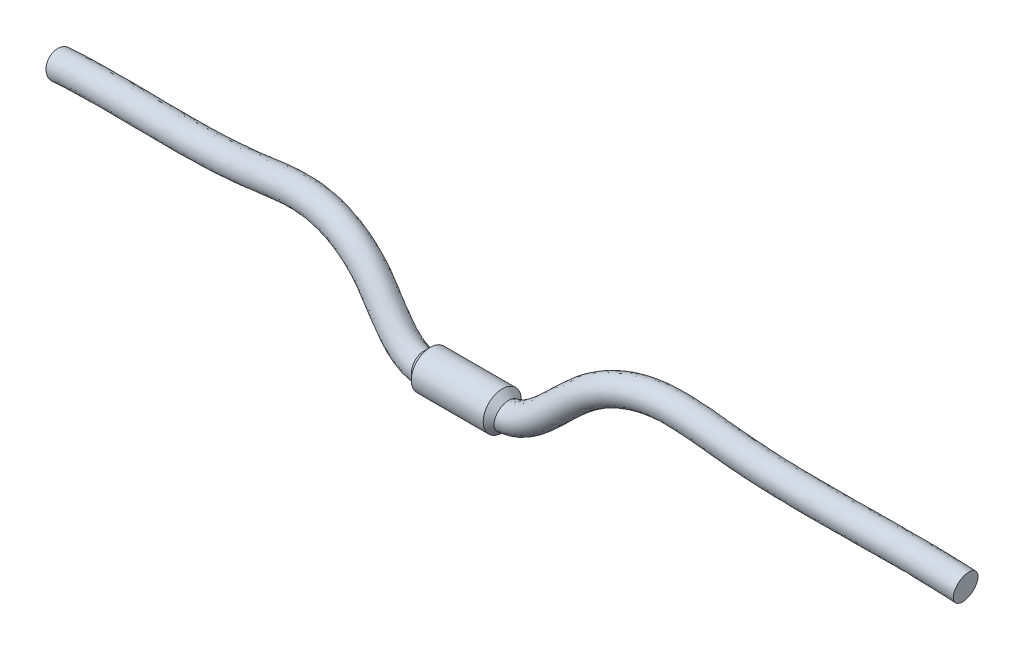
ISO-10303-21;
HEADER;
FILE_DESCRIPTION(('STEP AP214'),'2;1');
FILE_NAME('part.step','',(''),(''),'','','');
FILE_SCHEMA(('AUTOMOTIVE_DESIGN { 1 0 10303 214 1 1 1 1 }'));
ENDSEC;
DATA;
#1=APPLICATION_CONTEXT('core data for automotive mechanical design processes');
#2=APPLICATION_PROTOCOL_DEFINITION('international standard','automotive_design',2000,#1);
#3=PRODUCT_CONTEXT('',#1,'mechanical');
#4=PRODUCT('Part','Part','',(#3));
#5=PRODUCT_RELATED_PRODUCT_CATEGORY('part','',(#4));
#6=PRODUCT_DEFINITION_FORMATION('','',#4);
#7=PRODUCT_DEFINITION_CONTEXT('part definition',#1,'design');
#8=PRODUCT_DEFINITION('design','',#6,#7);
#9=PRODUCT_DEFINITION_SHAPE('','',#8);
#10=(LENGTH_UNIT() NAMED_UNIT(*) SI_UNIT(.MILLI.,.METRE.));
#11=(NAMED_UNIT(*) PLANE_ANGLE_UNIT() SI_UNIT($,.RADIAN.));
#12=(NAMED_UNIT(*) SI_UNIT($,.STERADIAN.) SOLID_ANGLE_UNIT());
#13=UNCERTAINTY_MEASURE_WITH_UNIT(LENGTH_MEASURE(1.E-05),#10,'distance_accuracy_value','');
#14=(GEOMETRIC_REPRESENTATION_CONTEXT(3) GLOBAL_UNCERTAINTY_ASSIGNED_CONTEXT((#13)) GLOBAL_UNIT_ASSIGNED_CONTEXT((#10,
#11,#12)) REPRESENTATION_CONTEXT('',''));
#15=CARTESIAN_POINT('',(0.,0.,0.));
#16=DIRECTION('',(0.,0.,1.));
#17=DIRECTION('',(1.,0.,0.));
#18=AXIS2_PLACEMENT_3D('',#15,#16,#17);
#19=CARTESIAN_POINT('',(377.5,27.,-39.));
#20=DIRECTION('',(0.986645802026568,-0.142129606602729,-0.0795564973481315));
#21=DIRECTION('',(0.142581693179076,0.98978303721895,1.95231058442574E-06));
#22=AXIS2_PLACEMENT_3D('',#19,#20,#21);
#23=PLANE('',#22);
#24=CARTESIAN_POINT('',(377.5,27.,-39.));
#25=DIRECTION('',(0.986645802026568,-0.142129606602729,-0.0795564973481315));
#26=DIRECTION('',(0.142581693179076,0.98978303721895,1.95231058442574E-06));
#27=AXIS2_PLACEMENT_3D('',#24,#25,#26);
#28=CIRCLE('',#27,11.1);
#29=CARTESIAN_POINT('',(379.082656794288,37.9865917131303,-38.9999783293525));
#30=VERTEX_POINT('',#29);
#31=EDGE_CURVE('E104',#30,#30,#28,.T.);
#32=ORIENTED_EDGE('',*,*,#31,.T.);
#33=EDGE_LOOP('',(#32));
#34=FACE_BOUND('',#33,.T.);
#35=ADVANCED_FACE('F43',(#34),#23,.T.);
#36=CARTESIAN_POINT('',(-379.082655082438,37.9865919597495,-39.));
#37=CARTESIAN_POINT('',(-348.820429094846,42.345966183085,-36.5598571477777));
#38=CARTESIAN_POINT('',(-318.997901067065,44.5450038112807,-33.7259870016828));
#39=CARTESIAN_POINT('',(-260.113273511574,49.8227016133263,-27.886747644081));
#40=CARTESIAN_POINT('',(-231.055447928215,52.8995056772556,-24.8818753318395));
#41=CARTESIAN_POINT('',(-192.475470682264,60.8950454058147,-21.1215513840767));
#42=CARTESIAN_POINT('',(-182.360661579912,63.3465506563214,-20.1562300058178));
#43=CARTESIAN_POINT('',(-161.422863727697,67.0181435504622,-18.0968240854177));
#44=CARTESIAN_POINT('',(-150.571110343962,68.2427852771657,-16.999893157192));
#45=CARTESIAN_POINT('',(-129.476753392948,66.9943686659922,-14.6980417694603));
#46=CARTESIAN_POINT('',(-119.634925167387,64.9436688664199,-13.5553211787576));
#47=CARTESIAN_POINT('',(-100.761451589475,58.0229794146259,-10.996157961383));
#48=CARTESIAN_POINT('',(-91.7281589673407,53.1507518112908,-9.57938941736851));
#49=CARTESIAN_POINT('',(-78.6023219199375,43.2391336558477,-6.99529850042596));
#50=CARTESIAN_POINT('',(-74.201345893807,39.2489684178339,-6.00543853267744));
#51=CARTESIAN_POINT('',(-65.9064147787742,31.4117239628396,-4.10908377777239));
#52=CARTESIAN_POINT('',(-62.0103620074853,27.5610135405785,-3.2019187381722));
#53=CARTESIAN_POINT('',(-54.4897732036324,20.7026103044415,-1.60759295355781));
#54=CARTESIAN_POINT('',(-50.8662423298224,17.7048516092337,-0.922735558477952));
#55=CARTESIAN_POINT('',(-45.6379359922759,14.2808604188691,-0.145892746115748));
#56=CARTESIAN_POINT('',(-43.9324188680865,13.3161059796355,0.0717938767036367));
#57=CARTESIAN_POINT('',(-40.5880273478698,11.7591525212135,0.422205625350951));
#58=CARTESIAN_POINT('',(-38.9512767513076,11.1657314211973,0.555200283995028));
#59=CARTESIAN_POINT('',(-35.2430028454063,10.225475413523,0.765959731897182));
#60=CARTESIAN_POINT('',(-32.8758664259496,9.91633179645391,0.83525462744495));
#61=CARTESIAN_POINT('',(-27.5417353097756,9.68094134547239,0.888017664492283));
#62=CARTESIAN_POINT('',(-24.5846642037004,9.7558545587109,0.871225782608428));
#63=CARTESIAN_POINT('',(-18.2210894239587,10.112017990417,0.791391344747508));
#64=CARTESIAN_POINT('',(-14.8164471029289,10.3913724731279,0.728773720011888));
#65=CARTESIAN_POINT('',(-7.65776276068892,10.8779642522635,0.619703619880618));
#66=CARTESIAN_POINT('',(-3.9024901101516,11.0851873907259,0.573254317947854));
#67=CARTESIAN_POINT('',(3.9024901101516,11.0851873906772,0.573254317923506));
#68=CARTESIAN_POINT('',(7.65776276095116,10.8779642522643,0.619703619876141));
#69=CARTESIAN_POINT('',(14.8164471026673,10.3913724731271,0.728773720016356));
#70=CARTESIAN_POINT('',(18.2210894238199,10.1120179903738,0.791391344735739));
#71=CARTESIAN_POINT('',(24.5846642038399,9.75585455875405,0.871225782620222));
#72=CARTESIAN_POINT('',(27.541735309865,9.68094134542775,0.888017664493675));
#73=CARTESIAN_POINT('',(32.8758664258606,9.91633179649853,0.835254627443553));
#74=CARTESIAN_POINT('',(35.2430028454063,10.2254754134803,0.765959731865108));
#75=CARTESIAN_POINT('',(38.9512767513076,11.1657314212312,0.555200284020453));
#76=CARTESIAN_POINT('',(40.5880273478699,11.7591525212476,0.422205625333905));
#77=CARTESIAN_POINT('',(43.9324188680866,13.3161059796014,0.0717938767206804));
#78=CARTESIAN_POINT('',(45.6379357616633,14.2808604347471,-0.145894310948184));
#79=CARTESIAN_POINT('',(50.8662423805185,17.704851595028,-0.922735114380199));
#80=CARTESIAN_POINT('',(54.489772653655,20.7026102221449,-1.60759571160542));
#81=CARTESIAN_POINT('',(62.0103637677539,27.5610137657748,-3.20190965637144));
#82=CARTESIAN_POINT('',(65.9064146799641,31.4117239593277,-4.10908435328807));
#83=CARTESIAN_POINT('',(74.2013515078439,39.2489692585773,-6.00541037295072));
#84=CARTESIAN_POINT('',(78.6023252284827,43.2391340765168,-6.99528143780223));
#85=CARTESIAN_POINT('',(91.7281618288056,53.1507518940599,-9.5793722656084));
#86=CARTESIAN_POINT('',(100.761454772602,58.0229793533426,-10.9961368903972));
#87=CARTESIAN_POINT('',(119.634927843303,64.9436686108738,-13.5552998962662));
#88=CARTESIAN_POINT('',(129.476755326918,66.9943684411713,-14.6980250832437));
#89=CARTESIAN_POINT('',(150.571112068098,68.2427850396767,-16.9998764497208));
#90=CARTESIAN_POINT('',(161.422865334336,67.0181433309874,-18.0968078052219));
#91=CARTESIAN_POINT('',(182.360663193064,63.3465504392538,-20.1562127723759));
#92=CARTESIAN_POINT('',(192.475472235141,60.8950451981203,-21.1215347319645));
#93=CARTESIAN_POINT('',(231.055449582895,52.8995054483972,-24.8818586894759));
#94=CARTESIAN_POINT('',(260.113275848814,49.8227012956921,-27.8867243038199));
#95=CARTESIAN_POINT('',(318.997902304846,44.5450036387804,-33.7259738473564));
#96=CARTESIAN_POINT('',(348.820431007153,42.345965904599,-36.5598354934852));
#97=CARTESIAN_POINT('',(379.082656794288,37.9865917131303,-38.9999783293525));
#98=CARTESIAN_POINT('',(-380.83076463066,37.7347709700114,-16.8703660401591));
#99=CARTESIAN_POINT('',(-350.78426165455,42.0630695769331,-14.4476176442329));
#100=CARTESIAN_POINT('',(-321.103727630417,44.2535467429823,-11.6279325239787));
#101=CARTESIAN_POINT('',(-262.33578093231,49.5207822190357,-5.80026377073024));
#102=CARTESIAN_POINT('',(-233.252243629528,52.5957124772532,-2.79267824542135));
#103=CARTESIAN_POINT('',(-194.536426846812,60.6194043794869,0.980885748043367));
#104=CARTESIAN_POINT('',(-184.430135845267,63.0681124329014,1.94541512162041));
#105=CARTESIAN_POINT('',(-163.599175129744,66.7209681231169,3.9943126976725));
#106=CARTESIAN_POINT('',(-152.849255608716,67.929098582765,5.08118010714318));
#107=CARTESIAN_POINT('',(-132.032955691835,66.6971380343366,7.3526894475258));
#108=CARTESIAN_POINT('',(-122.402689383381,64.678667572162,8.47184288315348));
#109=CARTESIAN_POINT('',(-104.077716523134,57.9590246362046,10.9566322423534));
#110=CARTESIAN_POINT('',(-95.3819221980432,53.2564881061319,12.3223597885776));
#111=CARTESIAN_POINT('',(-82.8274507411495,43.7763210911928,14.7939656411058));
#112=CARTESIAN_POINT('',(-78.5281967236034,39.886938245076,15.7594978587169));
#113=CARTESIAN_POINT('',(-70.2807962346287,32.0946562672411,17.6449845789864));
#114=CARTESIAN_POINT('',(-66.3316342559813,28.1896921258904,18.5653309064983));
#115=CARTESIAN_POINT('',(-58.5125889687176,21.0591284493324,20.2229277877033));
#116=CARTESIAN_POINT('',(-54.6430439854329,17.8379496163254,20.9591456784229));
#117=CARTESIAN_POINT('',(-48.7813884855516,13.9991989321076,21.8300950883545));
#118=CARTESIAN_POINT('',(-46.8192648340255,12.8841655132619,22.0817220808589));
#119=CARTESIAN_POINT('',(-42.8564261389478,11.0393037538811,22.4969327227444));
#120=CARTESIAN_POINT('',(-40.856694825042,10.3089626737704,22.6606295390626));
#121=CARTESIAN_POINT('',(-36.2338421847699,9.13680952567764,22.9233689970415));
#122=CARTESIAN_POINT('',(-33.4499692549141,8.78920574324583,23.0012847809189));
#123=CARTESIAN_POINT('',(-27.5068706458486,8.52694209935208,23.0600714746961));
#124=CARTESIAN_POINT('',(-24.3520294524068,8.61279480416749,23.0408274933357));
#125=CARTESIAN_POINT('',(-17.7702311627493,8.98117200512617,22.9582553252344));
#126=CARTESIAN_POINT('',(-14.3440964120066,9.26285896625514,22.8951148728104));
#127=CARTESIAN_POINT('',(-7.30068380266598,9.74161546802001,22.7878010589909));
#128=CARTESIAN_POINT('',(-3.6828622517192,9.93867875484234,22.7436290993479));
#129=CARTESIAN_POINT('',(3.68286225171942,9.93867875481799,22.7436290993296));
#130=CARTESIAN_POINT('',(7.30068380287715,9.74161546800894,22.7878010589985));
#131=CARTESIAN_POINT('',(14.3440964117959,9.26285896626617,22.8951148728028));
#132=CARTESIAN_POINT('',(17.7702311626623,8.9811720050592,22.9582553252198));
#133=CARTESIAN_POINT('',(24.3520294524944,8.61279480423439,23.0408274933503));
#134=CARTESIAN_POINT('',(27.5068706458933,8.52694209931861,23.0600714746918));
#135=CARTESIAN_POINT('',(33.4499692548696,8.78920574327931,23.0012847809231));
#136=CARTESIAN_POINT('',(36.2338421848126,9.13680952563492,22.9233689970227));
#137=CARTESIAN_POINT('',(40.8566948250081,10.3089626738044,22.6606295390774));
#138=CARTESIAN_POINT('',(42.8564261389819,11.0393037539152,22.4969327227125));
#139=CARTESIAN_POINT('',(46.8192648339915,12.8841655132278,22.0817220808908));
#140=CARTESIAN_POINT('',(48.7813866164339,13.9992016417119,21.8300937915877));
#141=CARTESIAN_POINT('',(54.6430443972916,17.837948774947,20.9591460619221));
#142=CARTESIAN_POINT('',(58.5125845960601,21.0591324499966,20.2229256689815));
#143=CARTESIAN_POINT('',(66.3316483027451,28.1896786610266,18.5653379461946));
#144=CARTESIAN_POINT('',(70.2807956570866,32.0946574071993,17.6449840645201));
#145=CARTESIAN_POINT('',(78.5282404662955,39.8868965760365,15.7595196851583));
#146=CARTESIAN_POINT('',(82.8274760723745,43.7762947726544,14.7939791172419));
#147=CARTESIAN_POINT('',(95.3819428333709,53.2564582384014,12.3223741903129));
#148=CARTESIAN_POINT('',(104.077737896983,57.958985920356,10.9566505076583));
#149=CARTESIAN_POINT('',(122.402702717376,64.6786255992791,8.47186237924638));
#150=CARTESIAN_POINT('',(132.032962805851,66.6971044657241,7.35270510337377));
#151=CARTESIAN_POINT('',(152.849255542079,67.9290645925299,5.08119654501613));
#152=CARTESIAN_POINT('',(163.599172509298,66.7209354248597,3.99432896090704));
#153=CARTESIAN_POINT('',(184.430130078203,63.0680783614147,1.94543262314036));
#154=CARTESIAN_POINT('',(194.536420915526,60.6193715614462,0.980902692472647));
#155=CARTESIAN_POINT('',(233.252240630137,52.595679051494,-2.79266158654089));
#156=CARTESIAN_POINT('',(262.335778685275,49.5207352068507,-5.80024060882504));
#157=CARTESIAN_POINT('',(321.103726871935,44.2535202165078,-11.627919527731));
#158=CARTESIAN_POINT('',(350.784259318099,42.0630259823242,-14.447596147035));
#159=CARTESIAN_POINT('',(380.830760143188,37.7347276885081,-16.8703443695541));
#160=CARTESIAN_POINT('',(-377.665454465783,15.7615870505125,-16.8703660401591));
#161=CARTESIAN_POINT('',(-348.612971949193,19.9466937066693,-14.5277687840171));
#162=CARTESIAN_POINT('',(-319.338968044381,22.122965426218,-11.7522565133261));
#163=CARTESIAN_POINT('',(-260.11696630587,27.4308968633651,-5.87956631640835));
#164=CARTESIAN_POINT('',(-230.164295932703,30.5644407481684,-2.78179269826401));
#165=CARTESIAN_POINT('',(-189.569314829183,38.9775816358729,1.17493020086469));
#166=CARTESIAN_POINT('',(-179.672082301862,41.3638873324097,2.11984367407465));
#167=CARTESIAN_POINT('',(-160.704242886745,44.6900313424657,3.9854854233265));
#168=CARTESIAN_POINT('',(-151.665915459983,45.624744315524,4.90302013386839));
#169=CARTESIAN_POINT('',(-135.455854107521,44.6653924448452,6.67188900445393));
#170=CARTESIAN_POINT('',(-127.911405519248,43.0878619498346,7.54833361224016));
#171=CARTESIAN_POINT('',(-113.547338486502,37.8206424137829,9.49597088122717));
#172=CARTESIAN_POINT('',(-106.729926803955,34.1340652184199,10.5666033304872));
#173=CARTESIAN_POINT('',(-96.8890990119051,26.7030322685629,12.5039726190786));
#174=CARTESIAN_POINT('',(-93.1397248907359,23.346074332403,13.3400877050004));
#175=CARTESIAN_POINT('',(-85.3690006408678,16.0041611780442,15.1166381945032));
#176=CARTESIAN_POINT('',(-81.3508303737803,12.0244033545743,16.0561249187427));
#177=CARTESIAN_POINT('',(-72.6693802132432,4.10736728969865,17.896560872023));
#178=CARTESIAN_POINT('',(-68.0044283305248,0.154641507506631,18.8010841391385));
#179=CARTESIAN_POINT('',(-59.9704315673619,-5.10676630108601,19.9948269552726));
#180=CARTESIAN_POINT('',(-57.1154823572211,-6.74584451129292,20.3648151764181));
#181=CARTESIAN_POINT('',(-50.9737509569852,-9.60507196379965,21.0083269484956));
#182=CARTESIAN_POINT('',(-47.6837048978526,-10.8232897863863,21.2814246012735));
#183=CARTESIAN_POINT('',(-39.7839672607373,-12.8263175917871,21.7304055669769));
#184=CARTESIAN_POINT('',(-35.5069488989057,-13.3117222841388,21.8392095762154));
#185=CARTESIAN_POINT('',(-27.3819524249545,-13.6702711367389,21.91957870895));
#186=CARTESIAN_POINT('',(-23.5185116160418,-13.5452228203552,21.8915489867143));
#187=CARTESIAN_POINT('',(-16.1548301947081,-13.1330843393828,21.7991676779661));
#188=CARTESIAN_POINT('',(-12.6516892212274,-12.8430402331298,21.7341539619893));
#189=CARTESIAN_POINT('',(-6.02128904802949,-12.3923571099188,21.6331328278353));
#190=CARTESIAN_POINT('',(-2.89594741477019,-12.2316960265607,21.5971204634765));
#191=CARTESIAN_POINT('',(2.8959474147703,-12.2316960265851,21.5971204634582));
#192=CARTESIAN_POINT('',(6.02128904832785,-12.3923571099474,21.6331328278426));
#193=CARTESIAN_POINT('',(12.6516892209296,-12.8430402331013,21.734153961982));
#194=CARTESIAN_POINT('',(16.1548301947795,-13.1330843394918,21.7991676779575));
#195=CARTESIAN_POINT('',(23.5185116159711,-13.5452228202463,21.8915489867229));
#196=CARTESIAN_POINT('',(27.3819524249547,-13.670271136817,21.9195787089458));
#197=CARTESIAN_POINT('',(35.5069488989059,-13.3117222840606,21.8392095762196));
#198=CARTESIAN_POINT('',(39.7839672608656,-12.826317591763,21.7304055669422));
#199=CARTESIAN_POINT('',(47.6837048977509,-10.8232897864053,21.281424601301));
#200=CARTESIAN_POINT('',(50.973750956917,-9.605071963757,21.0083269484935));
#201=CARTESIAN_POINT('',(57.1154823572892,-6.7458445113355,20.3648151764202));
#202=CARTESIAN_POINT('',(59.9704301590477,-5.10676362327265,19.9948287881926));
#203=CARTESIAN_POINT('',(68.0044286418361,0.154640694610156,18.8010836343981));
#204=CARTESIAN_POINT('',(72.6693769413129,4.10737145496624,17.8965642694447));
#205=CARTESIAN_POINT('',(81.350840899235,12.0243894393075,16.0561137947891));
#206=CARTESIAN_POINT('',(85.3690002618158,16.0041623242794,15.1166388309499));
#207=CARTESIAN_POINT('',(93.1397574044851,23.3460309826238,13.3400532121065));
#208=CARTESIAN_POINT('',(96.8891177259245,26.7030051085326,12.5039519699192));
#209=CARTESIAN_POINT('',(106.729941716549,34.1340351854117,10.5665834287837));
#210=CARTESIAN_POINT('',(113.547353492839,37.8206038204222,9.49594700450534));
#211=CARTESIAN_POINT('',(127.91141350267,43.0878204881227,7.54831054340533));
#212=CARTESIAN_POINT('',(135.455857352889,44.6653593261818,6.67187128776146));
#213=CARTESIAN_POINT('',(151.665911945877,45.6247107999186,4.90300315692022));
#214=CARTESIAN_POINT('',(160.704237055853,44.6899990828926,3.98546912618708));
#215=CARTESIAN_POINT('',(179.67207330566,41.3638536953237,2.11982670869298));
#216=CARTESIAN_POINT('',(189.569305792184,38.9775492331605,1.17491384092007));
#217=CARTESIAN_POINT('',(230.164289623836,30.5644077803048,-2.78180932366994));
#218=CARTESIAN_POINT('',(260.116959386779,27.4308504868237,-5.87958983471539));
#219=CARTESIAN_POINT('',(319.338964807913,22.1229392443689,-11.752269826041));
#220=CARTESIAN_POINT('',(348.612965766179,19.9466506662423,-14.5277905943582));
#221=CARTESIAN_POINT('',(377.665446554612,15.7615442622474,-16.8703877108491));
#222=CARTESIAN_POINT('',(-375.917344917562,16.0134080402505,-39.));
#223=CARTESIAN_POINT('',(-346.64913938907,20.2295903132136,-36.6400082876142));
#224=CARTESIAN_POINT('',(-317.233141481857,22.4144224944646,-33.8503109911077));
#225=CARTESIAN_POINT('',(-257.894458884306,27.7328162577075,-27.9660501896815));
#226=CARTESIAN_POINT('',(-227.967500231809,30.8682339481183,-24.8709897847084));
#227=CARTESIAN_POINT('',(-187.508358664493,39.2532226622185,-20.9275069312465));
#228=CARTESIAN_POINT('',(-177.602608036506,41.642325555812,-19.9818014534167));
#229=CARTESIAN_POINT('',(-158.527931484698,44.9872067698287,-18.1056513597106));
#230=CARTESIAN_POINT('',(-149.387770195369,45.9384310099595,-17.1780531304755));
#231=CARTESIAN_POINT('',(-132.899651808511,44.9626230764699,-15.3788422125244));
#232=CARTESIAN_POINT('',(-125.143641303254,43.3528632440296,-14.4788304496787));
#233=CARTESIAN_POINT('',(-110.231073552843,37.8845971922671,-12.4568193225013));
#234=CARTESIAN_POINT('',(-103.076163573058,34.0283289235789,-11.3351458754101));
#235=CARTESIAN_POINT('',(-92.6639701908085,26.1658448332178,-9.28529152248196));
#236=CARTESIAN_POINT('',(-88.8128740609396,22.7081045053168,-8.42484868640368));
#237=CARTESIAN_POINT('',(-80.9946191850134,15.3212288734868,-6.63743016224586));
#238=CARTESIAN_POINT('',(-77.0295581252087,11.3957247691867,-5.71112472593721));
#239=CARTESIAN_POINT('',(-68.6465644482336,3.75084914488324,-3.93395986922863));
#240=CARTESIAN_POINT('',(-64.227626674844,0.0215435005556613,-3.08079709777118));
#241=CARTESIAN_POINT('',(-56.8269790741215,-4.82510481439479,-1.98116087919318));
#242=CARTESIAN_POINT('',(-54.2286363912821,-6.31390404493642,-1.64511302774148));
#243=CARTESIAN_POINT('',(-48.7053521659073,-8.88522319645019,-1.06640014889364));
#244=CARTESIAN_POINT('',(-45.7782868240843,-9.96652103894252,-0.824004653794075));
#245=CARTESIAN_POINT('',(-38.7931279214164,-11.7376517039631,-0.427003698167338));
#246=CARTESIAN_POINT('',(-34.9328460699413,-12.1845962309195,-0.326820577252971));
#247=CARTESIAN_POINT('',(-27.4168170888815,-12.5162718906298,-0.252475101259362));
#248=CARTESIAN_POINT('',(-23.7511463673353,-12.4021630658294,-0.278052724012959));
#249=CARTESIAN_POINT('',(-16.6056884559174,-12.0022383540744,-0.367696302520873));
#250=CARTESIAN_POINT('',(-13.1240399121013,-11.714526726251,-0.432187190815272));
#251=CARTESIAN_POINT('',(-6.37836800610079,-11.2560083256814,-0.534964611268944));
#252=CARTESIAN_POINT('',(-3.11557527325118,-11.0851873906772,-0.573254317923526));
#253=CARTESIAN_POINT('',(3.11557527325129,-11.0851873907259,-0.573254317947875));
#254=CARTESIAN_POINT('',(6.37836800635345,-11.256008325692,-0.534964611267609));
#255=CARTESIAN_POINT('',(13.1240399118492,-11.7145267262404,-0.432187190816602));
#256=CARTESIAN_POINT('',(16.6056884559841,-12.0022383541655,-0.367696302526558));
#257=CARTESIAN_POINT('',(23.7511463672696,-12.4021630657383,-0.278052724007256));
#258=CARTESIAN_POINT('',(27.416817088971,-12.5162718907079,-0.252475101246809));
#259=CARTESIAN_POINT('',(34.9328460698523,-12.1845962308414,-0.326820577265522));
#260=CARTESIAN_POINT('',(38.7931279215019,-11.7376517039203,-0.427003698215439));
#261=CARTESIAN_POINT('',(45.7782868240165,-9.96652103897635,-0.824004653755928));
#262=CARTESIAN_POINT('',(48.7053521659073,-8.88522319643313,-1.06640014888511));
#263=CARTESIAN_POINT('',(54.228636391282,-6.31390404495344,-1.64511302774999));
#264=CARTESIAN_POINT('',(56.8269793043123,-4.82510483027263,-1.98115931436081));
#265=CARTESIAN_POINT('',(64.2276266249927,0.0215435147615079,-3.08079754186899));
#266=CARTESIAN_POINT('',(68.6465649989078,3.75084922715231,-3.93395711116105));
#267=CARTESIAN_POINT('',(77.0295563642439,11.3957245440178,-5.71113380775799));
#268=CARTESIAN_POINT('',(80.9946192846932,15.321228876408,-6.63742958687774));
#269=CARTESIAN_POINT('',(88.8128684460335,22.7081036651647,-8.424876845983));
#270=CARTESIAN_POINT('',(92.6639668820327,26.165844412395,-9.28530858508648));
#271=CARTESIAN_POINT('',(103.076160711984,34.0283288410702,-11.3351630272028));
#272=CARTESIAN_POINT('',(110.231070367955,37.8845972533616,-12.4568403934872));
#273=CARTESIAN_POINT('',(125.1436386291,43.3528634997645,-14.4788517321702));
#274=CARTESIAN_POINT('',(132.899649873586,44.9626233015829,-15.3788588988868));
#275=CARTESIAN_POINT('',(149.387768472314,45.9384312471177,-17.1780698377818));
#276=CARTESIAN_POINT('',(158.527929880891,44.9872069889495,-18.1056676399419));
#277=CARTESIAN_POINT('',(177.602606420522,41.6423257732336,-19.9818186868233));
#278=CARTESIAN_POINT('',(187.508357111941,39.2532228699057,-20.9275235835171));
#279=CARTESIAN_POINT('',(227.967498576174,30.8682341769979,-24.871006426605));
#280=CARTESIAN_POINT('',(257.894456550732,27.7328165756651,-27.9660735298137));
#281=CARTESIAN_POINT('',(317.23314024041,22.4144226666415,-33.850324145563));
#282=CARTESIAN_POINT('',(346.649137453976,20.2295905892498,-36.6400299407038));
#283=CARTESIAN_POINT('',(375.917343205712,16.0134082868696,-39.0000216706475));
#284=CARTESIAN_POINT('',(-374.16923536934,16.2652290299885,-61.1296339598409));
#285=CARTESIAN_POINT('',(-344.685306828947,20.512486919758,-58.7522477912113));
#286=CARTESIAN_POINT('',(-315.127314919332,22.7058795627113,-55.9483654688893));
#287=CARTESIAN_POINT('',(-255.671951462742,28.0347356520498,-50.0525340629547));
#288=CARTESIAN_POINT('',(-225.770704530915,31.1720271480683,-46.9601868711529));
#289=CARTESIAN_POINT('',(-185.447402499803,39.5288636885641,-43.0299440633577));
#290=CARTESIAN_POINT('',(-175.53313377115,41.9207637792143,-42.0834465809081));
#291=CARTESIAN_POINT('',(-156.351620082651,45.2843821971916,-40.1967881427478));
#292=CARTESIAN_POINT('',(-147.109624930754,46.2521177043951,-39.2591263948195));
#293=CARTESIAN_POINT('',(-130.3434495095,45.2598537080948,-37.4295734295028));
#294=CARTESIAN_POINT('',(-122.37587708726,43.6178645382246,-36.5059945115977));
#295=CARTESIAN_POINT('',(-106.914808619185,37.9485519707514,-34.4096095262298));
#296=CARTESIAN_POINT('',(-99.4224003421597,33.9225926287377,-33.2368950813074));
#297=CARTESIAN_POINT('',(-88.4388413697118,25.6286573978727,-31.0745556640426));
#298=CARTESIAN_POINT('',(-84.4860232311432,22.0701346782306,-30.1897850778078));
#299=CARTESIAN_POINT('',(-76.620237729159,14.6382965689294,-28.3914985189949));
#300=CARTESIAN_POINT('',(-72.7082858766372,10.7670461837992,-27.4783743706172));
#301=CARTESIAN_POINT('',(-64.6237486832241,3.39433100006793,-25.7644806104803));
#302=CARTESIAN_POINT('',(-60.4508250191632,-0.111554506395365,-24.9626783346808));
#303=CARTESIAN_POINT('',(-53.683526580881,-4.54344332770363,-23.957148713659));
#304=CARTESIAN_POINT('',(-51.3417904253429,-5.88196357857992,-23.655041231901));
#305=CARTESIAN_POINT('',(-46.4369533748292,-8.16537442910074,-23.1411272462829));
#306=CARTESIAN_POINT('',(-43.8728687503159,-9.10975229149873,-22.9294339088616));
#307=CARTESIAN_POINT('',(-37.8022885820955,-10.6489858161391,-22.5844129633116));
#308=CARTESIAN_POINT('',(-34.3587432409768,-11.0574701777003,-22.4928507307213));
#309=CARTESIAN_POINT('',(-27.4516817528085,-11.3622726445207,-22.4245289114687));
#310=CARTESIAN_POINT('',(-23.9837811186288,-11.2591033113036,-22.4476544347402));
#311=CARTESIAN_POINT('',(-17.0565467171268,-10.871392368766,-22.5345602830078));
#312=CARTESIAN_POINT('',(-13.5963906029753,-10.5860132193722,-22.5985283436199));
#313=CARTESIAN_POINT('',(-6.73544696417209,-10.119659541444,-22.7030620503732));
#314=CARTESIAN_POINT('',(-3.33520313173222,-9.93867875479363,-22.7436290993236));
#315=CARTESIAN_POINT('',(3.33520313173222,-9.93867875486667,-22.743629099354));
#316=CARTESIAN_POINT('',(6.73544696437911,-10.1196595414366,-22.7030620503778));
#317=CARTESIAN_POINT('',(13.596390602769,-10.5860132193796,-22.5985283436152));
#318=CARTESIAN_POINT('',(17.0565467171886,-10.8713923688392,-22.5345602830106));
#319=CARTESIAN_POINT('',(23.983781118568,-11.2591033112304,-22.4476544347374));
#320=CARTESIAN_POINT('',(27.4516817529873,-11.3622726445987,-22.4245289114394));
#321=CARTESIAN_POINT('',(34.3587432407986,-11.0574701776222,-22.4928507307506));
#322=CARTESIAN_POINT('',(37.8022885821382,-10.6489858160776,-22.584412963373));
#323=CARTESIAN_POINT('',(43.872868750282,-9.1097522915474,-22.9294339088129));
#324=CARTESIAN_POINT('',(46.4369533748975,-8.16537442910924,-23.1411272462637));
#325=CARTESIAN_POINT('',(51.3417904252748,-5.88196357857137,-23.6550412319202));
#326=CARTESIAN_POINT('',(53.6835284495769,-4.54344603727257,-23.9571474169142));
#327=CARTESIAN_POINT('',(60.4508246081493,-0.111553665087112,-24.9626787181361));
#328=CARTESIAN_POINT('',(64.6237530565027,3.39432699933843,-25.7644784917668));
#329=CARTESIAN_POINT('',(72.7082718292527,10.7670596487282,-27.4783814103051));
#330=CARTESIAN_POINT('',(76.6202383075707,14.6382954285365,-28.3914980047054));
#331=CARTESIAN_POINT('',(84.4859794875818,22.0701763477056,-30.1898069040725));
#332=CARTESIAN_POINT('',(88.4388160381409,25.6286837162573,-31.0745691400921));
#333=CARTESIAN_POINT('',(99.4223797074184,33.9226224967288,-33.2369094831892));
#334=CARTESIAN_POINT('',(106.914787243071,37.948590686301,-34.4096277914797));
#335=CARTESIAN_POINT('',(122.37586375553,43.6179065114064,-36.5060140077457));
#336=CARTESIAN_POINT('',(130.343442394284,45.2598872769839,-37.4295890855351));
#337=CARTESIAN_POINT('',(147.109624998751,46.2521516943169,-39.2591428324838));
#338=CARTESIAN_POINT('',(156.35162270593,45.2844148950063,-40.1968044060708));
#339=CARTESIAN_POINT('',(175.533139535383,41.9207978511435,-42.0834640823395));
#340=CARTESIAN_POINT('',(185.447408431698,39.528896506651,-43.0299610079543));
#341=CARTESIAN_POINT('',(225.770707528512,31.172060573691,-46.9602035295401));
#342=CARTESIAN_POINT('',(255.671953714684,28.0347826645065,-50.052557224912));
#343=CARTESIAN_POINT('',(315.127315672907,22.705906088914,-55.948378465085));
#344=CARTESIAN_POINT('',(344.685309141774,20.5125305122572,-58.7522692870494));
#345=CARTESIAN_POINT('',(374.169239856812,16.2652723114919,-61.1296556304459));
#346=CARTESIAN_POINT('',(-377.334545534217,38.2384129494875,-61.1296339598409));
#347=CARTESIAN_POINT('',(-346.856596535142,42.6288627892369,-58.6720966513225));
#348=CARTESIAN_POINT('',(-316.892074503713,44.8364608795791,-55.8240414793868));
#349=CARTESIAN_POINT('',(-257.890766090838,50.1246210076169,-49.9732315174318));
#350=CARTESIAN_POINT('',(-228.858652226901,53.2032988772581,-46.9710724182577));
#351=CARTESIAN_POINT('',(-190.414514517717,61.1706864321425,-43.2239885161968));
#352=CARTESIAN_POINT('',(-180.291187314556,63.6249888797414,-42.2578751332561));
#353=CARTESIAN_POINT('',(-159.24655232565,67.3153189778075,-40.187960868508));
#354=CARTESIAN_POINT('',(-148.292965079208,68.5564719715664,-39.0809664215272));
#355=CARTESIAN_POINT('',(-126.92055109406,67.2915992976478,-36.7487729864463));
#356=CARTESIAN_POINT('',(-116.867160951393,65.2086701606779,-35.5824852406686));
#357=CARTESIAN_POINT('',(-97.4451866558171,58.0869341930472,-32.9489481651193));
#358=CARTESIAN_POINT('',(-88.0743957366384,53.0450155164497,-31.4811386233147));
#359=CARTESIAN_POINT('',(-74.3771930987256,42.7019462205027,-28.7845626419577));
#360=CARTESIAN_POINT('',(-69.8744950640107,38.6109985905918,-27.7703749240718));
#361=CARTESIAN_POINT('',(-61.5320333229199,30.7287916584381,-25.8631521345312));
#362=CARTESIAN_POINT('',(-57.6890897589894,26.9323349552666,-24.9691683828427));
#363=CARTESIAN_POINT('',(-50.4669574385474,20.3460921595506,-23.4381136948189));
#364=CARTESIAN_POINT('',(-47.089440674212,17.571753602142,-22.8046167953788));
#365=CARTESIAN_POINT('',(-42.4944834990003,14.5625219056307,-22.1218805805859));
#366=CARTESIAN_POINT('',(-41.0455729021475,13.748046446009,-21.9381343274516));
#367=CARTESIAN_POINT('',(-38.319628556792,12.479001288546,-21.6525214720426));
#368=CARTESIAN_POINT('',(-37.0458586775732,12.0225001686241,-21.5502289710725));
#369=CARTESIAN_POINT('',(-34.2521635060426,11.3141413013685,-21.3914495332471));
#370=CARTESIAN_POINT('',(-32.3017635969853,11.043457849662,-21.330775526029));
#371=CARTESIAN_POINT('',(-27.5765999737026,10.8349405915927,-21.2840361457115));
#372=CARTESIAN_POINT('',(-24.817298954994,10.8989143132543,-21.2983759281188));
#373=CARTESIAN_POINT('',(-18.6719476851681,11.2428639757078,-21.3754726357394));
#374=CARTESIAN_POINT('',(-15.2887977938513,11.5198859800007,-21.4375674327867));
#375=CARTESIAN_POINT('',(-8.01484171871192,12.014313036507,-21.5483938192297));
#376=CARTESIAN_POINT('',(-4.12211796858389,12.2316960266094,-21.5971204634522));
#377=CARTESIAN_POINT('',(4.12211796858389,12.2316960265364,-21.5971204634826));
#378=CARTESIAN_POINT('',(8.01484171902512,12.0143130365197,-21.5483938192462));
#379=CARTESIAN_POINT('',(15.2887977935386,11.519885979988,-21.4375674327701));
#380=CARTESIAN_POINT('',(18.6719476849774,11.2428639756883,-21.3754726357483));
#381=CARTESIAN_POINT('',(24.8172989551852,10.8989143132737,-21.2983759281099));
#382=CARTESIAN_POINT('',(27.5765999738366,10.8349405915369,-21.2840361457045));
#383=CARTESIAN_POINT('',(32.3017635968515,11.0434578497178,-21.3307755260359));
#384=CARTESIAN_POINT('',(34.2521635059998,11.3141413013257,-21.3914495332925));
#385=CARTESIAN_POINT('',(37.0458586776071,12.022500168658,-21.5502289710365));
#386=CARTESIAN_POINT('',(38.3196285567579,12.47900128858,-21.6525214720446));
#387=CARTESIAN_POINT('',(41.0455729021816,13.7480464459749,-21.9381343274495));
#388=CARTESIAN_POINT('',(42.4944849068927,14.5625192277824,-22.121882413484));
#389=CARTESIAN_POINT('',(47.0894403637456,17.571754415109,-22.8046162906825));
#390=CARTESIAN_POINT('',(50.4669607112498,20.3460879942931,-23.4381170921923));
#391=CARTESIAN_POINT('',(57.6890792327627,26.9323488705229,-24.9691572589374));
#392=CARTESIAN_POINT('',(61.5320337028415,30.7287905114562,-25.8631527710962));
#393=CARTESIAN_POINT('',(69.8744625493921,38.6110419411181,-27.7703404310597));
#394=CARTESIAN_POINT('',(74.3771743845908,42.7019733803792,-28.7845419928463));
#395=CARTESIAN_POINT('',(88.0743808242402,53.0450455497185,-31.4811187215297));
#396=CARTESIAN_POINT('',(97.4451716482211,58.0869727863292,-32.9489242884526));
#397=CARTESIAN_POINT('',(116.86715296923,65.2087116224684,-35.5824621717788));
#398=CARTESIAN_POINT('',(126.920547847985,67.2916324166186,-36.7487552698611));
#399=CARTESIAN_POINT('',(148.292968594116,68.5565054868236,-39.0809494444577));
#400=CARTESIAN_POINT('',(159.246558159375,67.315351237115,-40.1879445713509));
#401=CARTESIAN_POINT('',(180.291196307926,63.6250225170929,-42.2578581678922));
#402=CARTESIAN_POINT('',(190.414523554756,61.1707188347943,-43.2239721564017));
#403=CARTESIAN_POINT('',(228.858658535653,53.2033318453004,-46.971055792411));
#404=CARTESIAN_POINT('',(257.890773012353,50.1246673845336,-49.9732079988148));
#405=CARTESIAN_POINT('',(316.892077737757,44.836487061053,-55.8240281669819));
#406=CARTESIAN_POINT('',(346.856602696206,42.6289058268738,-58.6720748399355));
#407=CARTESIAN_POINT('',(377.334553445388,38.2384557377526,-61.1296122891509));
#408=CARTESIAN_POINT('',(-379.082655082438,37.9865919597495,-39.));
#409=CARTESIAN_POINT('',(-348.820429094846,42.345966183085,-36.5598571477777));
#410=CARTESIAN_POINT('',(-318.997901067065,44.5450038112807,-33.7259870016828));
#411=CARTESIAN_POINT('',(-260.113273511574,49.8227016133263,-27.886747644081));
#412=CARTESIAN_POINT('',(-231.055447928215,52.8995056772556,-24.8818753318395));
#413=CARTESIAN_POINT('',(-192.475470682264,60.8950454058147,-21.1215513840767));
#414=CARTESIAN_POINT('',(-182.360661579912,63.3465506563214,-20.1562300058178));
#415=CARTESIAN_POINT('',(-161.422863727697,67.0181435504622,-18.0968240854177));
#416=CARTESIAN_POINT('',(-150.571110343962,68.2427852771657,-16.999893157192));
#417=CARTESIAN_POINT('',(-129.476753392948,66.9943686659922,-14.6980417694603));
#418=CARTESIAN_POINT('',(-119.634925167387,64.9436688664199,-13.5553211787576));
#419=CARTESIAN_POINT('',(-100.761451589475,58.0229794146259,-10.996157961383));
#420=CARTESIAN_POINT('',(-91.7281589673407,53.1507518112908,-9.57938941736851));
#421=CARTESIAN_POINT('',(-78.6023219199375,43.2391336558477,-6.99529850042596));
#422=CARTESIAN_POINT('',(-74.201345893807,39.2489684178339,-6.00543853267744));
#423=CARTESIAN_POINT('',(-65.9064147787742,31.4117239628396,-4.10908377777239));
#424=CARTESIAN_POINT('',(-62.0103620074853,27.5610135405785,-3.2019187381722));
#425=CARTESIAN_POINT('',(-54.4897732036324,20.7026103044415,-1.60759295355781));
#426=CARTESIAN_POINT('',(-50.8662423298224,17.7048516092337,-0.922735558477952));
#427=CARTESIAN_POINT('',(-45.6379359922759,14.2808604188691,-0.145892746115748));
#428=CARTESIAN_POINT('',(-43.9324188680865,13.3161059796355,0.0717938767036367));
#429=CARTESIAN_POINT('',(-40.5880273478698,11.7591525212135,0.422205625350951));
#430=CARTESIAN_POINT('',(-38.9512767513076,11.1657314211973,0.555200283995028));
#431=CARTESIAN_POINT('',(-35.2430028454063,10.225475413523,0.765959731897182));
#432=CARTESIAN_POINT('',(-32.8758664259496,9.91633179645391,0.83525462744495));
#433=CARTESIAN_POINT('',(-27.5417353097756,9.68094134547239,0.888017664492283));
#434=CARTESIAN_POINT('',(-24.5846642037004,9.7558545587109,0.871225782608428));
#435=CARTESIAN_POINT('',(-18.2210894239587,10.112017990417,0.791391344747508));
#436=CARTESIAN_POINT('',(-14.8164471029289,10.3913724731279,0.728773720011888));
#437=CARTESIAN_POINT('',(-7.65776276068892,10.8779642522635,0.619703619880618));
#438=CARTESIAN_POINT('',(-3.9024901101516,11.0851873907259,0.573254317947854));
#439=CARTESIAN_POINT('',(3.9024901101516,11.0851873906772,0.573254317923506));
#440=CARTESIAN_POINT('',(7.65776276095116,10.8779642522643,0.619703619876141));
#441=CARTESIAN_POINT('',(14.8164471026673,10.3913724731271,0.728773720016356));
#442=CARTESIAN_POINT('',(18.2210894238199,10.1120179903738,0.791391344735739));
#443=CARTESIAN_POINT('',(24.5846642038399,9.75585455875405,0.871225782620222));
#444=CARTESIAN_POINT('',(27.541735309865,9.68094134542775,0.888017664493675));
#445=CARTESIAN_POINT('',(32.8758664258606,9.91633179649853,0.835254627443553));
#446=CARTESIAN_POINT('',(35.2430028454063,10.2254754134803,0.765959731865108));
#447=CARTESIAN_POINT('',(38.9512767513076,11.1657314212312,0.555200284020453));
#448=CARTESIAN_POINT('',(40.5880273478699,11.7591525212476,0.422205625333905));
#449=CARTESIAN_POINT('',(43.9324188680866,13.3161059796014,0.0717938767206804));
#450=CARTESIAN_POINT('',(45.6379357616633,14.2808604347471,-0.145894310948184));
#451=CARTESIAN_POINT('',(50.8662423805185,17.704851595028,-0.922735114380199));
#452=CARTESIAN_POINT('',(54.489772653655,20.7026102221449,-1.60759571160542));
#453=CARTESIAN_POINT('',(62.0103637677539,27.5610137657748,-3.20190965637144));
#454=CARTESIAN_POINT('',(65.9064146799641,31.4117239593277,-4.10908435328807));
#455=CARTESIAN_POINT('',(74.2013515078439,39.2489692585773,-6.00541037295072));
#456=CARTESIAN_POINT('',(78.6023252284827,43.2391340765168,-6.99528143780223));
#457=CARTESIAN_POINT('',(91.7281618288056,53.1507518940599,-9.5793722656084));
#458=CARTESIAN_POINT('',(100.761454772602,58.0229793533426,-10.9961368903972));
#459=CARTESIAN_POINT('',(119.634927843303,64.9436686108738,-13.5552998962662));
#460=CARTESIAN_POINT('',(129.476755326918,66.9943684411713,-14.6980250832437));
#461=CARTESIAN_POINT('',(150.571112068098,68.2427850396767,-16.9998764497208));
#462=CARTESIAN_POINT('',(161.422865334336,67.0181433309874,-18.0968078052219));
#463=CARTESIAN_POINT('',(182.360663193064,63.3465504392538,-20.1562127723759));
#464=CARTESIAN_POINT('',(192.475472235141,60.8950451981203,-21.1215347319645));
#465=CARTESIAN_POINT('',(231.055449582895,52.8995054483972,-24.8818586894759));
#466=CARTESIAN_POINT('',(260.113275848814,49.8227012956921,-27.8867243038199));
#467=CARTESIAN_POINT('',(318.997902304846,44.5450036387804,-33.7259738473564));
#468=CARTESIAN_POINT('',(348.820431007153,42.345965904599,-36.5598354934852));
#469=CARTESIAN_POINT('',(379.082656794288,37.9865917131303,-38.9999783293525));
#470=(BOUNDED_SURFACE() B_SPLINE_SURFACE(3,3,((#36,#37,#38,#39,#40,#41,#42,#43,#44,#45,#46,#47,
#48,#49,#50,#51,#52,#53,#54,#55,#56,#57,#58,#59,#60,#61,#62,#63,#64,#65,#66,#67,#68,#69,#70,#71,
#72,#73,#74,#75,#76,#77,#78,#79,#80,#81,#82,#83,#84,#85,#86,#87,#88,#89,#90,#91,#92,#93,#94,#95,
#96,#97),(#98,#99,#100,#101,#102,#103,#104,#105,#106,#107,#108,#109,#110,#111,#112,#113,#114,
#115,#116,#117,#118,#119,#120,#121,#122,#123,#124,#125,#126,#127,#128,#129,#130,#131,#132,#133,
#134,#135,#136,#137,#138,#139,#140,#141,#142,#143,#144,#145,#146,#147,#148,#149,#150,#151,#152,
#153,#154,#155,#156,#157,#158,#159),(#160,#161,#162,#163,#164,#165,#166,#167,#168,#169,#170,
#171,#172,#173,#174,#175,#176,#177,#178,#179,#180,#181,#182,#183,#184,#185,#186,#187,#188,#189,
#190,#191,#192,#193,#194,#195,#196,#197,#198,#199,#200,#201,#202,#203,#204,#205,#206,#207,#208,
#209,#210,#211,#212,#213,#214,#215,#216,#217,#218,#219,#220,#221),(#222,#223,#224,#225,#226,
#227,#228,#229,#230,#231,#232,#233,#234,#235,#236,#237,#238,#239,#240,#241,#242,#243,#244,#245,
#246,#247,#248,#249,#250,#251,#252,#253,#254,#255,#256,#257,#258,#259,#260,#261,#262,#263,#264,
#265,#266,#267,#268,#269,#270,#271,#272,#273,#274,#275,#276,#277,#278,#279,#280,#281,#282,#283),
(#284,#285,#286,#287,#288,#289,#290,#291,#292,#293,#294,#295,#296,#297,#298,#299,#300,#301,#302,
#303,#304,#305,#306,#307,#308,#309,#310,#311,#312,#313,#314,#315,#316,#317,#318,#319,#320,#321,
#322,#323,#324,#325,#326,#327,#328,#329,#330,#331,#332,#333,#334,#335,#336,#337,#338,#339,#340,
#341,#342,#343,#344,#345),(#346,#347,#348,#349,#350,#351,#352,#353,#354,#355,#356,#357,#358,
#359,#360,#361,#362,#363,#364,#365,#366,#367,#368,#369,#370,#371,#372,#373,#374,#375,#376,#377,
#378,#379,#380,#381,#382,#383,#384,#385,#386,#387,#388,#389,#390,#391,#392,#393,#394,#395,#396,
#397,#398,#399,#400,#401,#402,#403,#404,#405,#406,#407),(#408,#409,#410,#411,#412,#413,#414,
#415,#416,#417,#418,#419,#420,#421,#422,#423,#424,#425,#426,#427,#428,#429,#430,#431,#432,#433,
#434,#435,#436,#437,#438,#439,#440,#441,#442,#443,#444,#445,#446,#447,#448,#449,#450,#451,#452,
#453,#454,#455,#456,#457,#458,#459,#460,#461,#462,#463,#464,#465,#466,#467,#468,#469)),
.UNSPECIFIED.,.T.,.F.,.F.) B_SPLINE_SURFACE_WITH_KNOTS((4,3,4),(4,2,2,2,2,2,2,2,2,2,2,2,2,2,2,2,
2,2,2,2,2,2,2,2,2,2,2,2,2,2,4),(0.,0.5,1.),(0.,0.112885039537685,0.22577007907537,
0.264052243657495,0.30233440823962,0.336137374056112,0.369940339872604,0.389882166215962,
0.409823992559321,0.429765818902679,0.439736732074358,0.449707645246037,0.462280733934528,
0.474853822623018,0.487426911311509,0.5,0.512573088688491,0.525146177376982,0.537719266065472,
0.550292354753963,0.560263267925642,0.570234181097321,0.590176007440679,0.610117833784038,
0.630059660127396,0.663862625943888,0.69766559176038,0.735947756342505,0.774229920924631,
0.887114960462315,1.),
.UNSPECIFIED.) GEOMETRIC_REPRESENTATION_ITEM() RATIONAL_B_SPLINE_SURFACE(((1.,1.,1.,1.,1.,1.,1.,
1.,1.,1.,1.,1.,1.,1.,1.,1.,1.,1.,1.,1.,1.,1.,1.,1.,1.,1.,1.,1.,1.,1.,1.,1.,1.,1.,1.,1.,1.,1.,1.,
1.,1.,1.,1.,1.,1.,1.,1.,1.,1.,1.,1.,1.,1.,1.,1.,1.,1.,1.,1.,1.,1.,1.),(0.333333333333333,
0.333333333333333,0.333333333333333,0.333333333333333,0.333333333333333,0.333333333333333,
0.333333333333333,0.333333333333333,0.333333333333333,0.333333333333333,0.333333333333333,
0.333333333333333,0.333333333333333,0.333333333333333,0.333333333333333,0.333333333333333,
0.333333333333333,0.333333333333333,0.333333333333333,0.333333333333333,0.333333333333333,
0.333333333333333,0.333333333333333,0.333333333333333,0.333333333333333,0.333333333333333,
0.333333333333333,0.333333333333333,0.333333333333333,0.333333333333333,0.333333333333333,
0.333333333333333,0.333333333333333,0.333333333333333,0.333333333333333,0.333333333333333,
0.333333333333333,0.333333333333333,0.333333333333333,0.333333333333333,0.333333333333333,
0.333333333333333,0.333333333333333,0.333333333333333,0.333333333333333,0.333333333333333,
0.333333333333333,0.333333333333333,0.333333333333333,0.333333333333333,0.333333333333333,
0.333333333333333,0.333333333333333,0.333333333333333,0.333333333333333,0.333333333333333,
0.333333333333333,0.333333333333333,0.333333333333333,0.333333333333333,0.333333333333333,
0.333333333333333),(0.333333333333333,0.333333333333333,0.333333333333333,0.333333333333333,
0.333333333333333,0.333333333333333,0.333333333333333,0.333333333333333,0.333333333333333,
0.333333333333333,0.333333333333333,0.333333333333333,0.333333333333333,0.333333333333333,
0.333333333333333,0.333333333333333,0.333333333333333,0.333333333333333,0.333333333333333,
0.333333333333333,0.333333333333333,0.333333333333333,0.333333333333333,0.333333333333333,
0.333333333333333,0.333333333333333,0.333333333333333,0.333333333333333,0.333333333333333,
0.333333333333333,0.333333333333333,0.333333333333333,0.333333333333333,0.333333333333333,
0.333333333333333,0.333333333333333,0.333333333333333,0.333333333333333,0.333333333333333,
0.333333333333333,0.333333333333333,0.333333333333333,0.333333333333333,0.333333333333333,
0.333333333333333,0.333333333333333,0.333333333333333,0.333333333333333,0.333333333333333,
0.333333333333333,0.333333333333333,0.333333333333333,0.333333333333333,0.333333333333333,
0.333333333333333,0.333333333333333,0.333333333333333,0.333333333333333,0.333333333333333,
0.333333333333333,0.333333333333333,0.333333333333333),(1.,1.,1.,1.,1.,1.,1.,1.,1.,1.,1.,1.,1.,
1.,1.,1.,1.,1.,1.,1.,1.,1.,1.,1.,1.,1.,1.,1.,1.,1.,1.,1.,1.,1.,1.,1.,1.,1.,1.,1.,1.,1.,1.,1.,1.,
1.,1.,1.,1.,1.,1.,1.,1.,1.,1.,1.,1.,1.,1.,1.,1.,1.),(0.333333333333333,0.333333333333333,
0.333333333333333,0.333333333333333,0.333333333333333,0.333333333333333,0.333333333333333,
0.333333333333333,0.333333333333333,0.333333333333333,0.333333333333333,0.333333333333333,
0.333333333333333,0.333333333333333,0.333333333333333,0.333333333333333,0.333333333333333,
0.333333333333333,0.333333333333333,0.333333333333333,0.333333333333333,0.333333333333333,
0.333333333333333,0.333333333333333,0.333333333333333,0.333333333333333,0.333333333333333,
0.333333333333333,0.333333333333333,0.333333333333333,0.333333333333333,0.333333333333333,
0.333333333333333,0.333333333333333,0.333333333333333,0.333333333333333,0.333333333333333,
0.333333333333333,0.333333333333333,0.333333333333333,0.333333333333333,0.333333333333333,
0.333333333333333,0.333333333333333,0.333333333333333,0.333333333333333,0.333333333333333,
0.333333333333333,0.333333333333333,0.333333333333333,0.333333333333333,0.333333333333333,
0.333333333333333,0.333333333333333,0.333333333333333,0.333333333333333,0.333333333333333,
0.333333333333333,0.333333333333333,0.333333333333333,0.333333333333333,0.333333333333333),
(0.333333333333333,0.333333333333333,0.333333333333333,0.333333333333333,0.333333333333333,
0.333333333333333,0.333333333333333,0.333333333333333,0.333333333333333,0.333333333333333,
0.333333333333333,0.333333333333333,0.333333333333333,0.333333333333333,0.333333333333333,
0.333333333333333,0.333333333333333,0.333333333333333,0.333333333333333,0.333333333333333,
0.333333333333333,0.333333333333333,0.333333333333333,0.333333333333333,0.333333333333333,
0.333333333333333,0.333333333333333,0.333333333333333,0.333333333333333,0.333333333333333,
0.333333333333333,0.333333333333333,0.333333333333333,0.333333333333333,0.333333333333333,
0.333333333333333,0.333333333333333,0.333333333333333,0.333333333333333,0.333333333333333,
0.333333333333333,0.333333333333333,0.333333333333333,0.333333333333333,0.333333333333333,
0.333333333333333,0.333333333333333,0.333333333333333,0.333333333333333,0.333333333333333,
0.333333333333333,0.333333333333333,0.333333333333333,0.333333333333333,0.333333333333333,
0.333333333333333,0.333333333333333,0.333333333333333,0.333333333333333,0.333333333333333,
0.333333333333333,0.333333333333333),(1.,1.,1.,1.,1.,1.,1.,1.,1.,1.,1.,1.,1.,1.,1.,1.,1.,1.,1.,
1.,1.,1.,1.,1.,1.,1.,1.,1.,1.,1.,1.,1.,1.,1.,1.,1.,1.,1.,1.,1.,1.,1.,1.,1.,1.,1.,1.,1.,1.,1.,1.,
1.,1.,1.,1.,1.,1.,1.,1.,1.,1.,1.))) REPRESENTATION_ITEM('') SURFACE());
#471=CARTESIAN_POINT('',(33.7835241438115,-11.8588683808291,-2.48520178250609));
#472=CARTESIAN_POINT('',(33.7976671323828,-11.7834545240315,-2.77612006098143));
#473=CARTESIAN_POINT('',(33.8129120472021,-11.6961721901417,-3.06386187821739));
#474=CARTESIAN_POINT('',(33.8454789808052,-11.4984941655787,-3.63126593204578));
#475=CARTESIAN_POINT('',(33.8628014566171,-11.3880933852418,-3.91092637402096));
#476=CARTESIAN_POINT('',(33.899385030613,-11.1448873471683,-4.46052857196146));
#477=CARTESIAN_POINT('',(33.918648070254,-11.0120595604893,-4.73046022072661));
#478=CARTESIAN_POINT('',(33.9589271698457,-10.7250367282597,-5.25858634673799));
#479=CARTESIAN_POINT('',(33.9799432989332,-10.5708408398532,-5.51678036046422));
#480=CARTESIAN_POINT('',(34.0243069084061,-10.2363970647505,-6.02863733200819));
#481=CARTESIAN_POINT('',(34.0477103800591,-10.0554237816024,-6.28182174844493));
#482=CARTESIAN_POINT('',(34.0959682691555,-9.67310471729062,-6.77217009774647));
#483=CARTESIAN_POINT('',(34.1208227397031,-9.47175819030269,-7.00933344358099));
#484=CARTESIAN_POINT('',(34.1717383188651,-9.05019563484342,-7.46605643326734));
#485=CARTESIAN_POINT('',(34.197799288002,-8.82998178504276,-7.68561810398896));
#486=CARTESIAN_POINT('',(34.2508777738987,-8.37224370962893,-8.10576312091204));
#487=CARTESIAN_POINT('',(34.2778953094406,-8.13471914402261,-8.30634609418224));
#488=CARTESIAN_POINT('',(34.3331146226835,-7.63963938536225,-8.69068023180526));
#489=CARTESIAN_POINT('',(34.3613289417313,-7.38180174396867,-8.8740658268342));
#490=CARTESIAN_POINT('',(34.4181939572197,-6.85177261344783,-9.21868761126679));
#491=CARTESIAN_POINT('',(34.446844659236,-6.57958094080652,-9.37992351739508));
#492=CARTESIAN_POINT('',(34.504300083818,-6.02273511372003,-9.67924269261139));
#493=CARTESIAN_POINT('',(34.53310482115,-5.73807974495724,-9.81732369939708));
#494=CARTESIAN_POINT('',(34.590582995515,-5.15830413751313,-10.0694546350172));
#495=CARTESIAN_POINT('',(34.6192564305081,-4.86318373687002,-10.1835041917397));
#496=CARTESIAN_POINT('',(34.6766981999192,-4.25922119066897,-10.3886570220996));
#497=CARTESIAN_POINT('',(34.7054593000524,-3.95022887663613,-10.4793204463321));
#498=CARTESIAN_POINT('',(34.7622820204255,-3.3256710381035,-10.6344442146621));
#499=CARTESIAN_POINT('',(34.7903436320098,-3.01010543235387,-10.6989042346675));
#500=CARTESIAN_POINT('',(34.8455096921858,-2.37458125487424,-10.8012015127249));
#501=CARTESIAN_POINT('',(34.8726140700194,-2.05462236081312,-10.8390368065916));
#502=CARTESIAN_POINT('',(34.9256267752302,-1.41256922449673,-10.8878126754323));
#503=CARTESIAN_POINT('',(34.9515351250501,-1.090475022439,-10.8987537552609));
#504=CARTESIAN_POINT('',(35.0021757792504,-0.443487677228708,-10.8936144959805));
#505=CARTESIAN_POINT('',(35.0268953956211,-0.118595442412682,-10.8772899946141));
#506=CARTESIAN_POINT('',(35.0747262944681,0.528766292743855,-10.8172111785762));
#507=CARTESIAN_POINT('',(35.0978375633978,0.85123577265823,-10.7734566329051));
#508=CARTESIAN_POINT('',(35.1423090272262,1.49142670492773,-10.6587437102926));
#509=CARTESIAN_POINT('',(35.1636692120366,1.80914812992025,-10.5877851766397));
#510=CARTESIAN_POINT('',(35.2045347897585,2.43751611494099,-10.4190642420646));
#511=CARTESIAN_POINT('',(35.2240401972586,2.74816273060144,-10.3213020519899));
#512=CARTESIAN_POINT('',(35.261025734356,3.35830244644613,-10.1001939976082));
#513=CARTESIAN_POINT('',(35.2785169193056,3.65784963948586,-9.97699928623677));
#514=CARTESIAN_POINT('',(35.3115796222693,4.24542321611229,-9.70543661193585));
#515=CARTESIAN_POINT('',(35.3271511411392,4.53344960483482,-9.55706866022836));
#516=CARTESIAN_POINT('',(35.3563853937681,5.09575441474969,-9.23610720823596));
#517=CARTESIAN_POINT('',(35.3700482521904,5.37003373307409,-9.0635152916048));
#518=CARTESIAN_POINT('',(35.3955097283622,5.90271053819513,-8.69522868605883));
#519=CARTESIAN_POINT('',(35.4073083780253,6.16110829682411,-8.49953439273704));
#520=CARTESIAN_POINT('',(35.4288976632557,6.65506968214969,-8.09041072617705));
#521=CARTESIAN_POINT('',(35.4387230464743,6.89098095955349,-7.87740287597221));
#522=CARTESIAN_POINT('',(35.4567314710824,7.3436831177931,-7.43188712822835));
#523=CARTESIAN_POINT('',(35.4649145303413,7.56047420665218,-7.19937944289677));
#524=CARTESIAN_POINT('',(35.4797300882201,7.97316547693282,-6.71650666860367));
#525=CARTESIAN_POINT('',(35.4863627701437,8.16906812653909,-6.46614369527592));
#526=CARTESIAN_POINT('',(35.4981732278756,8.53840462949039,-5.94932632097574));
#527=CARTESIAN_POINT('',(35.5033510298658,8.71183888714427,-5.68287220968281));
#528=CARTESIAN_POINT('',(35.5122291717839,9.03081922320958,-5.14257237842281));
#529=CARTESIAN_POINT('',(35.5159627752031,9.17694720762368,-4.86907060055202));
#530=CARTESIAN_POINT('',(35.5221991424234,9.44530115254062,-4.31056918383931));
#531=CARTESIAN_POINT('',(35.5247019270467,9.56752751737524,-4.02556973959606));
#532=CARTESIAN_POINT('',(35.5285275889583,9.78710099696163,-3.44616637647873));
#533=CARTESIAN_POINT('',(35.5298505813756,9.88445053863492,-3.15176337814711));
#534=CARTESIAN_POINT('',(35.5313457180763,10.0535279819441,-2.55568714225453));
#535=CARTESIAN_POINT('',(35.5315178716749,10.1252560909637,-2.2540139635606));
#536=CARTESIAN_POINT('',(35.5307218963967,10.2415689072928,-1.65074799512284));
#537=CARTESIAN_POINT('',(35.5297728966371,10.2865898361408,-1.34923918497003));
#538=CARTESIAN_POINT('',(35.5267460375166,10.3510556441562,-0.743509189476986));
#539=CARTESIAN_POINT('',(35.5246681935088,10.3705008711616,-0.439288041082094));
#540=CARTESIAN_POINT('',(35.5193417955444,10.3837382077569,0.169692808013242));
#541=CARTESIAN_POINT('',(35.5160932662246,10.3775308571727,0.474452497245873));
#542=CARTESIAN_POINT('',(35.5083650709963,10.3395987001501,1.08236293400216));
#543=CARTESIAN_POINT('',(35.5038853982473,10.3078737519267,1.38551367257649));
#544=CARTESIAN_POINT('',(35.4936162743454,10.2192044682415,1.98835598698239));
#545=CARTESIAN_POINT('',(35.4878256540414,10.1622375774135,2.28804422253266));
#546=CARTESIAN_POINT('',(35.4748548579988,10.0236106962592,2.88161852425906));
#547=CARTESIAN_POINT('',(35.467674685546,9.9419507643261,3.17550460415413));
#548=CARTESIAN_POINT('',(35.4518409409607,9.7546423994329,3.75550148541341));
#549=CARTESIAN_POINT('',(35.4431872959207,9.64899277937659,4.04161190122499));
#550=CARTESIAN_POINT('',(35.4243285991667,9.41457839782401,4.60414687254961));
#551=CARTESIAN_POINT('',(35.4141235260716,9.28581331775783,4.88057129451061));
#552=CARTESIAN_POINT('',(35.3919007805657,9.00371604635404,5.42671543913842));
#553=CARTESIAN_POINT('',(35.3798543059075,8.84999051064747,5.69623083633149));
#554=CARTESIAN_POINT('',(35.3540336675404,8.52086284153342,6.22159319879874));
#555=CARTESIAN_POINT('',(35.3402594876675,8.34546050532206,6.47744003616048));
#556=CARTESIAN_POINT('',(35.3109542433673,7.97429614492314,6.97383141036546));
#557=CARTESIAN_POINT('',(35.2954230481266,7.77853260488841,7.21437480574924));
#558=CARTESIAN_POINT('',(35.2626039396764,7.36808666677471,7.67862160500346));
#559=CARTESIAN_POINT('',(35.2453159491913,7.15340343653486,7.90232426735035));
#560=CARTESIAN_POINT('',(35.2085740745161,6.70123456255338,8.33668657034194));
#561=CARTESIAN_POINT('',(35.189077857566,6.46332242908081,8.54689879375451));
#562=CARTESIAN_POINT('',(35.1483432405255,5.97098831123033,8.94682035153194));
#563=CARTESIAN_POINT('',(35.1271048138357,5.71656607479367,9.13652937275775));
#564=CARTESIAN_POINT('',(35.0829884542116,5.19299574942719,9.49423908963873));
#565=CARTESIAN_POINT('',(35.0601103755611,4.92384635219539,9.66223785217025));
#566=CARTESIAN_POINT('',(35.0128560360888,4.37271438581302,9.97542868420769));
#567=CARTESIAN_POINT('',(34.9884797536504,4.09073163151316,10.1206204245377));
#568=CARTESIAN_POINT('',(34.9379187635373,3.51032124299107,10.3898274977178));
#569=CARTESIAN_POINT('',(34.9117082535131,3.21168138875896,10.5133806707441));
#570=CARTESIAN_POINT('',(34.8581249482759,2.60517876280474,10.7349695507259));
#571=CARTESIAN_POINT('',(34.8307521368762,2.29731586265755,10.8330049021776));
#572=CARTESIAN_POINT('',(34.775085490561,1.67450403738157,11.0028713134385));
#573=CARTESIAN_POINT('',(34.7467916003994,1.35955468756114,11.0747007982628));
#574=CARTESIAN_POINT('',(34.6895507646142,0.72479532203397,11.1916116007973));
#575=CARTESIAN_POINT('',(34.6606038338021,0.404985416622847,11.2366935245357));
#576=CARTESIAN_POINT('',(34.602160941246,-0.23923136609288,11.299932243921));
#577=CARTESIAN_POINT('',(34.5726627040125,-0.563654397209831,11.3179226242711));
#578=CARTESIAN_POINT('',(34.5135915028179,-1.21285243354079,11.3262437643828));
#579=CARTESIAN_POINT('',(34.4840185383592,-1.53762744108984,11.3165743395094));
#580=CARTESIAN_POINT('',(34.4251057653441,-2.18518611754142,11.2695463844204));
#581=CARTESIAN_POINT('',(34.3957659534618,-2.50796981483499,11.2321882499));
#582=CARTESIAN_POINT('',(34.3376278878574,-3.14919728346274,11.1299400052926));
#583=CARTESIAN_POINT('',(34.3088296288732,-3.46764109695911,11.0650501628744));
#584=CARTESIAN_POINT('',(34.2523281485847,-4.09507621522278,10.9087775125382));
#585=CARTESIAN_POINT('',(34.2246175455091,-4.4041258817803,10.8176317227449));
#586=CARTESIAN_POINT('',(34.1703168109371,-5.01337426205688,10.6091689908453));
#587=CARTESIAN_POINT('',(34.143726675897,-5.31357300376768,10.491852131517));
#588=CARTESIAN_POINT('',(34.0919456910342,-5.90285194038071,10.2317901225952));
#589=CARTESIAN_POINT('',(34.0667547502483,-6.19193285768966,10.0890466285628));
#590=CARTESIAN_POINT('',(34.0180321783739,-6.75679563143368,9.77906252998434));
#591=CARTESIAN_POINT('',(33.9945005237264,-7.03257767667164,9.61182227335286));
#592=CARTESIAN_POINT('',(33.949742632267,-7.56393058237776,9.25717648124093));
#593=CARTESIAN_POINT('',(33.9284827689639,-7.81977414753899,9.07018369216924));
#594=CARTESIAN_POINT('',(33.888009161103,-8.31464609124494,8.67493233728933));
#595=CARTESIAN_POINT('',(33.8687953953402,-8.55367464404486,8.46667399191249));
#596=CARTESIAN_POINT('',(33.8326055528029,-9.01306190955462,8.03036341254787));
#597=CARTESIAN_POINT('',(33.8156292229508,-9.23342273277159,7.80231342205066));
#598=CARTESIAN_POINT('',(33.7840783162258,-9.6537991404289,7.32802051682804));
#599=CARTESIAN_POINT('',(33.7695037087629,-9.85381498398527,7.08177783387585));
#600=CARTESIAN_POINT('',(33.7431412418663,-10.2284890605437,6.57753081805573));
#601=CARTESIAN_POINT('',(33.7313073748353,-10.4035434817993,6.31982318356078));
#602=CARTESIAN_POINT('',(33.7102020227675,-10.731217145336,5.79041866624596));
#603=CARTESIAN_POINT('',(33.7009305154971,-10.8838365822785,5.51872190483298));
#604=CARTESIAN_POINT('',(33.6850349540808,-11.1655062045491,4.9632418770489));
#605=CARTESIAN_POINT('',(33.6784113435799,-11.2945524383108,4.67945659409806));
#606=CARTESIAN_POINT('',(33.6678754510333,-11.5280638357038,4.10190297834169));
#607=CARTESIAN_POINT('',(33.6639631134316,-11.63252950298,3.80813485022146));
#608=CARTESIAN_POINT('',(33.6589150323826,-11.815040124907,3.21617903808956));
#609=CARTESIAN_POINT('',(33.6577478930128,-11.8933749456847,2.91808095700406));
#610=CARTESIAN_POINT('',(33.6581086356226,-12.0246928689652,2.31635440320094));
#611=CARTESIAN_POINT('',(33.6596365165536,-12.0776759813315,2.01272593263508));
#612=CARTESIAN_POINT('',(33.6653709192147,-12.1578781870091,1.40241319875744));
#613=CARTESIAN_POINT('',(33.6695747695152,-12.1851229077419,1.09573228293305));
#614=CARTESIAN_POINT('',(33.6806181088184,-12.213770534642,0.481311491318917));
#615=CARTESIAN_POINT('',(33.6874569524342,-12.2151797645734,0.173571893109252));
#616=CARTESIAN_POINT('',(33.7060786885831,-12.1888392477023,-0.530407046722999));
#617=CARTESIAN_POINT('',(33.7187212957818,-12.1524812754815,-0.926329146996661));
#618=CARTESIAN_POINT('',(33.7481110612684,-12.0372605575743,-1.71174545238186));
#619=CARTESIAN_POINT('',(33.7648578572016,-11.958401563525,-2.1012402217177));
#620=CARTESIAN_POINT('',(33.7835241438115,-11.8588683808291,-2.48520178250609));
#621=B_SPLINE_CURVE_WITH_KNOTS('',3,(#471,#472,#473,#474,#475,#476,#477,#478,#479,#480,#481,
#482,#483,#484,#485,#486,#487,#488,#489,#490,#491,#492,#493,#494,#495,#496,#497,#498,#499,#500,
#501,#502,#503,#504,#505,#506,#507,#508,#509,#510,#511,#512,#513,#514,#515,#516,#517,#518,#519,
#520,#521,#522,#523,#524,#525,#526,#527,#528,#529,#530,#531,#532,#533,#534,#535,#536,#537,#538,
#539,#540,#541,#542,#543,#544,#545,#546,#547,#548,#549,#550,#551,#552,#553,#554,#555,#556,#557,
#558,#559,#560,#561,#562,#563,#564,#565,#566,#567,#568,#569,#570,#571,#572,#573,#574,#575,#576,
#577,#578,#579,#580,#581,#582,#583,#584,#585,#586,#587,#588,#589,#590,#591,#592,#593,#594,#595,
#596,#597,#598,#599,#600,#601,#602,#603,#604,#605,#606,#607,#608,#609,#610,#611,#612,#613,#614,
#615,#616,#617,#618,#619,#620),.UNSPECIFIED.,.T.,.F.,(4,2,2,2,2,2,2,2,2,2,2,2,2,2,2,2,2,2,2,2,2,
2,2,2,2,2,2,2,2,2,2,2,2,2,2,2,2,2,2,2,2,2,2,2,2,2,2,2,2,2,2,2,2,2,2,2,2,2,2,2,2,2,2,2,2,2,2,2,2,
2,2,2,2,2,4),(0.,0.902272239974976,1.80474332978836,2.70812644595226,3.61154520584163,
4.54672989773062,5.48194883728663,6.41705992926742,7.35218939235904,8.30405810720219,
9.25593899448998,10.2079128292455,11.159901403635,12.1286685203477,13.0974476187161,
14.0662981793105,15.035130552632,16.0126853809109,16.9902484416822,17.9678171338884,
18.9453781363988,19.9172883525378,20.8891981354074,21.8610444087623,22.8328740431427,
23.7857041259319,24.7385238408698,25.6912308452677,26.6439207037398,27.5731343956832,
28.5023323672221,29.4314396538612,30.3605394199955,31.2740131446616,32.1874744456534,
33.100916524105,34.0143636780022,34.9286287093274,35.8428915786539,36.7571996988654,
37.6715204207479,38.6019719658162,39.5324322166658,40.4629617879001,41.3935323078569,
42.346652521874,43.2997872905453,44.2530068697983,45.2062402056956,46.1778486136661,
47.1494705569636,48.1211508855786,49.0928091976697,50.0704121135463,51.0480215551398,
52.0256170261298,53.0032029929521,53.9722267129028,54.9412473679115,55.9102049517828,
56.8791487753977,57.830815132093,58.7824716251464,59.7340203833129,60.685557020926,
61.6197265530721,62.5538879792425,63.4882058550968,64.4225045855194,65.3460649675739,
66.2696249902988,67.1922644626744,68.1146780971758,69.3056257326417,70.4964682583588),.UNSPECIFIED.);
#622=CARTESIAN_POINT('',(33.7835241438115,-11.8588683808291,-2.48520178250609));
#623=VERTEX_POINT('',#622);
#624=EDGE_CURVE('E60',#623,#623,#621,.T.);
#625=ORIENTED_EDGE('',*,*,#624,.T.);
#626=EDGE_LOOP('',(#625));
#627=FACE_BOUND('',#626,.T.);
#628=ORIENTED_EDGE('',*,*,#31,.F.);
#629=EDGE_LOOP('',(#628));
#630=FACE_BOUND('',#629,.T.);
#631=ADVANCED_FACE('F75',(#627,#630),#470,.T.);
#632=CARTESIAN_POINT('',(40.,0.,0.));
#633=DIRECTION('',(-1.,0.,0.));
#634=DIRECTION('',(0.,0.,1.));
#635=AXIS2_PLACEMENT_3D('',#632,#633,#634);
#636=CYLINDRICAL_SURFACE('',#635,15.9);
#637=CARTESIAN_POINT('',(-29.9999999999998,0.,0.));
#638=DIRECTION('',(1.,0.,0.));
#639=DIRECTION('',(0.,0.,-1.));
#640=AXIS2_PLACEMENT_3D('',#637,#638,#639);
#641=CIRCLE('',#640,15.9);
#642=CARTESIAN_POINT('',(-29.9999999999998,0.,-15.9));
#643=VERTEX_POINT('',#642);
#644=EDGE_CURVE('E56',#643,#643,#641,.T.);
#645=ORIENTED_EDGE('',*,*,#644,.T.);
#646=EDGE_LOOP('',(#645));
#647=FACE_BOUND('',#646,.T.);
#648=CARTESIAN_POINT('',(29.9999999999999,0.,0.));
#649=DIRECTION('',(1.,0.,0.));
#650=DIRECTION('',(0.,0.,-1.));
#651=AXIS2_PLACEMENT_3D('',#648,#649,#650);
#652=CIRCLE('',#651,15.9);
#653=CARTESIAN_POINT('',(29.9999999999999,0.,-15.9));
#654=VERTEX_POINT('',#653);
#655=EDGE_CURVE('E64',#654,#654,#652,.F.);
#656=ORIENTED_EDGE('',*,*,#655,.T.);
#657=EDGE_LOOP('',(#656));
#658=FACE_BOUND('',#657,.T.);
#659=ADVANCED_FACE('F82',(#647,#658),#636,.T.);
#660=CARTESIAN_POINT('',(-377.5,27.,-39.));
#661=DIRECTION('',(0.986645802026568,0.142129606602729,0.0795564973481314));
#662=DIRECTION('',(-0.142581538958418,0.989783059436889,0.));
#663=AXIS2_PLACEMENT_3D('',#660,#661,#662);
#664=PLANE('',#663);
#665=CARTESIAN_POINT('',(-377.5,27.,-39.));
#666=DIRECTION('',(0.986645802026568,0.142129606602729,0.0795564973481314));
#667=DIRECTION('',(-0.142581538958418,0.989783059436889,0.));
#668=AXIS2_PLACEMENT_3D('',#665,#666,#667);
#669=CIRCLE('',#668,11.1);
#670=CARTESIAN_POINT('',(-379.082655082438,37.9865919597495,-39.));
#671=VERTEX_POINT('',#670);
#672=EDGE_CURVE('E102',#671,#671,#669,.T.);
#673=ORIENTED_EDGE('',*,*,#672,.F.);
#674=EDGE_LOOP('',(#673));
#675=FACE_BOUND('',#674,.T.);
#676=ADVANCED_FACE('F93',(#675),#664,.F.);
#677=CARTESIAN_POINT('',(-33.7835241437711,-11.8588683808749,-2.48520178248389));
#678=CARTESIAN_POINT('',(-33.7693740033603,-11.9343229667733,-2.1941526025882));
#679=CARTESIAN_POINT('',(-33.756331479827,-11.9978728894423,-1.90001728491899));
#680=CARTESIAN_POINT('',(-33.7325656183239,-12.100726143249,-1.30735686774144));
#681=CARTESIAN_POINT('',(-33.7218427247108,-12.1400248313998,-1.00883093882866));
#682=CARTESIAN_POINT('',(-33.7028066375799,-12.1940425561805,-0.409225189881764));
#683=CARTESIAN_POINT('',(-33.6944955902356,-12.2087397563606,-0.108143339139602));
#684=CARTESIAN_POINT('',(-33.6803678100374,-12.2133446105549,0.494269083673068));
#685=CARTESIAN_POINT('',(-33.6745510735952,-12.2032523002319,0.795599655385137));
#686=CARTESIAN_POINT('',(-33.6653577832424,-12.1577941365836,1.40338268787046));
#687=CARTESIAN_POINT('',(-33.6620405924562,-12.1218508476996,1.70979302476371));
#688=CARTESIAN_POINT('',(-33.6581001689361,-12.0242910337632,2.31852431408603));
#689=CARTESIAN_POINT('',(-33.6574770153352,-11.9626737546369,2.62084514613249));
#690=CARTESIAN_POINT('',(-33.6589303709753,-11.814215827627,3.21917446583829));
#691=CARTESIAN_POINT('',(-33.6610064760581,-11.7273789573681,3.5151838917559));
#692=CARTESIAN_POINT('',(-33.6678388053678,-11.5291137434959,4.09881377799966));
#693=CARTESIAN_POINT('',(-33.672595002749,-11.4176856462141,4.38643432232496));
#694=CARTESIAN_POINT('',(-33.6847176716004,-11.1716014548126,4.95000363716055));
#695=CARTESIAN_POINT('',(-33.6920726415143,-11.0370490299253,5.22599793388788));
#696=CARTESIAN_POINT('',(-33.7093299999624,-10.7453750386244,5.76570597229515));
#697=CARTESIAN_POINT('',(-33.7192323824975,-10.5882535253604,6.02941974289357));
#698=CARTESIAN_POINT('',(-33.7414950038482,-10.2525958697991,6.54273949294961));
#699=CARTESIAN_POINT('',(-33.7538552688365,-10.0740594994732,6.79234532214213));
#700=CARTESIAN_POINT('',(-33.7809211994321,-9.69688203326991,7.27573713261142));
#701=CARTESIAN_POINT('',(-33.7956268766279,-9.49824083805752,7.50952303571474));
#702=CARTESIAN_POINT('',(-33.827329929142,-9.08123950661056,7.96084639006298));
#703=CARTESIAN_POINT('',(-33.8443386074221,-8.86278398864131,8.17829491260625));
#704=CARTESIAN_POINT('',(-33.8804317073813,-8.40861790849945,8.59416349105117));
#705=CARTESIAN_POINT('',(-33.8995161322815,-8.17290731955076,8.79258351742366));
#706=CARTESIAN_POINT('',(-33.9395834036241,-7.68592172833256,9.16910605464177));
#707=CARTESIAN_POINT('',(-33.9605663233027,-7.43464612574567,9.34720778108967));
#708=CARTESIAN_POINT('',(-34.0042331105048,-6.91832778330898,9.68195210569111));
#709=CARTESIAN_POINT('',(-34.0269169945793,-6.65328490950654,9.83859449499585));
#710=CARTESIAN_POINT('',(-34.074090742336,-6.10760468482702,10.1314317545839));
#711=CARTESIAN_POINT('',(-34.0986009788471,-5.82680422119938,10.2673194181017));
#712=CARTESIAN_POINT('',(-34.1489106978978,-5.25496968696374,10.5152211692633));
#713=CARTESIAN_POINT('',(-34.1747101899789,-4.96393554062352,10.6272350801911));
#714=CARTESIAN_POINT('',(-34.2273479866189,-4.37365732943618,10.826739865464));
#715=CARTESIAN_POINT('',(-34.2541863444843,-4.07441284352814,10.914229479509));
#716=CARTESIAN_POINT('',(-34.3086394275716,-3.46978283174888,11.0642003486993));
#717=CARTESIAN_POINT('',(-34.33625418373,-3.16439706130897,11.1266806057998));
#718=CARTESIAN_POINT('',(-34.3925053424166,-2.54388710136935,11.2272376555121));
#719=CARTESIAN_POINT('',(-34.42115119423,-2.22868722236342,11.2648424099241));
#720=CARTESIAN_POINT('',(-34.4786807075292,-1.596271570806,11.3136293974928));
#721=CARTESIAN_POINT('',(-34.5075643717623,-1.27905577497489,11.3248113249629));
#722=CARTESIAN_POINT('',(-34.5652848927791,-0.644764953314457,11.3207686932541));
#723=CARTESIAN_POINT('',(-34.594121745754,-0.327689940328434,11.3055420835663));
#724=CARTESIAN_POINT('',(-34.6514654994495,0.304137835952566,11.2488583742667));
#725=CARTESIAN_POINT('',(-34.6799723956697,0.618890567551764,11.2074009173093));
#726=CARTESIAN_POINT('',(-34.736857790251,1.24917396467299,11.0976804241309));
#727=CARTESIAN_POINT('',(-34.7652261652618,1.5646295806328,11.0289806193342));
#728=CARTESIAN_POINT('',(-34.8210746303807,2.18873762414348,10.8653261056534));
#729=CARTESIAN_POINT('',(-34.8485547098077,2.49738996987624,10.7703710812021));
#730=CARTESIAN_POINT('',(-34.9023828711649,3.10575380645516,10.5548706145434));
#731=CARTESIAN_POINT('',(-34.928730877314,3.40546469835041,10.4343234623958));
#732=CARTESIAN_POINT('',(-34.980074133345,3.99380991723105,10.168471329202));
#733=CARTESIAN_POINT('',(-35.0050694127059,4.28244448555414,10.0231668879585));
#734=CARTESIAN_POINT('',(-35.0536837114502,4.84848371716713,9.70772185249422));
#735=CARTESIAN_POINT('',(-35.0772924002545,5.12580029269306,9.53742154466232));
#736=CARTESIAN_POINT('',(-35.1227965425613,5.66511117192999,9.17386882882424));
#737=CARTESIAN_POINT('',(-35.1446919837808,5.92710536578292,8.98061625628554));
#738=CARTESIAN_POINT('',(-35.1866541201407,6.43381412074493,8.57246807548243));
#739=CARTESIAN_POINT('',(-35.2067208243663,6.67852876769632,8.35757257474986));
#740=CARTESIAN_POINT('',(-35.2449501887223,7.14880746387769,7.90760259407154));
#741=CARTESIAN_POINT('',(-35.2631128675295,7.37437170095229,7.67252831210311));
#742=CARTESIAN_POINT('',(-35.2973521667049,7.8027441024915,7.18590394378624));
#743=CARTESIAN_POINT('',(-35.3134452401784,8.00572975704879,6.93451127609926));
#744=CARTESIAN_POINT('',(-35.3437266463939,8.38951530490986,6.41521231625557));
#745=CARTESIAN_POINT('',(-35.3579149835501,8.57031524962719,6.14730606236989));
#746=CARTESIAN_POINT('',(-35.3844202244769,8.90822224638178,5.59688286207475));
#747=CARTESIAN_POINT('',(-35.3967372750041,9.06533115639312,5.31436706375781));
#748=CARTESIAN_POINT('',(-35.4195629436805,9.35452338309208,4.73673313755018));
#749=CARTESIAN_POINT('',(-35.4300715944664,9.48660715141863,4.44161523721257));
#750=CARTESIAN_POINT('',(-35.449157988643,9.72203905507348,3.84732876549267));
#751=CARTESIAN_POINT('',(-35.457772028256,9.82593833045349,3.54837964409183));
#752=CARTESIAN_POINT('',(-35.4734364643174,10.0077023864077,2.94262604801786));
#753=CARTESIAN_POINT('',(-35.4804868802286,10.0855674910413,2.63582167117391));
#754=CARTESIAN_POINT('',(-35.4931168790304,10.2145155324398,2.01664107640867));
#755=CARTESIAN_POINT('',(-35.4986966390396,10.2656016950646,1.7042655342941));
#756=CARTESIAN_POINT('',(-35.5084761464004,10.3404766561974,1.07623775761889));
#757=CARTESIAN_POINT('',(-35.5126759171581,10.3642659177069,0.760585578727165));
#758=CARTESIAN_POINT('',(-35.5196877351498,10.3840063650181,0.136061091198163));
#759=CARTESIAN_POINT('',(-35.5225309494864,10.3806182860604,-0.172790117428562));
#760=CARTESIAN_POINT('',(-35.5270342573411,10.3475108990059,-0.78908544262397));
#761=CARTESIAN_POINT('',(-35.5286943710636,10.3177920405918,-1.09652958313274));
#762=CARTESIAN_POINT('',(-35.5308665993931,10.2321941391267,-1.70773130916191));
#763=CARTESIAN_POINT('',(-35.5313788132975,10.1763173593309,-2.0114892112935));
#764=CARTESIAN_POINT('',(-35.531266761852,10.0387983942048,-2.61311494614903));
#765=CARTESIAN_POINT('',(-35.5306425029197,9.9571563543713,-2.91098281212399));
#766=CARTESIAN_POINT('',(-35.528260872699,9.77006262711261,-3.49447888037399));
#767=CARTESIAN_POINT('',(-35.5265196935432,9.66496495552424,-3.78022074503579));
#768=CARTESIAN_POINT('',(-35.521883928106,9.43112804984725,-4.34184698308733));
#769=CARTESIAN_POINT('',(-35.5189893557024,9.3023891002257,-4.61773147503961));
#770=CARTESIAN_POINT('',(-35.5119916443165,9.02225499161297,-5.15772601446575));
#771=CARTESIAN_POINT('',(-35.5078885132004,8.87085998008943,-5.42183613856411));
#772=CARTESIAN_POINT('',(-35.49840333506,8.54656995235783,-5.93648386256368));
#773=CARTESIAN_POINT('',(-35.4930212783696,8.37367477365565,-6.18702135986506));
#774=CARTESIAN_POINT('',(-35.4808725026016,8.00691537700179,-6.67388717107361));
#775=CARTESIAN_POINT('',(-35.474099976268,7.81296487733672,-6.9101503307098));
#776=CARTESIAN_POINT('',(-35.4591002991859,7.40616747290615,-7.36575038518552));
#777=CARTESIAN_POINT('',(-35.4508731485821,7.1933205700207,-7.58508728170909));
#778=CARTESIAN_POINT('',(-35.4328828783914,6.7502985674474,-8.00544661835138));
#779=CARTESIAN_POINT('',(-35.4231196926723,6.52012272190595,-8.20646826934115));
#780=CARTESIAN_POINT('',(-35.4019861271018,6.04411523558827,-8.58895105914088));
#781=CARTESIAN_POINT('',(-35.3906156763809,5.79828290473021,-8.77041133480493));
#782=CARTESIAN_POINT('',(-35.365972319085,5.28774410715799,-9.11604247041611));
#783=CARTESIAN_POINT('',(-35.3526664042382,5.02276158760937,-9.27980326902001));
#784=CARTESIAN_POINT('',(-35.3242899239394,4.48026001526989,-9.58486090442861));
#785=CARTESIAN_POINT('',(-35.3092193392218,4.20274082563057,-9.72615749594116));
#786=CARTESIAN_POINT('',(-35.277303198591,3.63710411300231,-9.98547504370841));
#787=CARTESIAN_POINT('',(-35.2604574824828,3.34898563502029,-10.1034938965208));
#788=CARTESIAN_POINT('',(-35.2250137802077,2.76416665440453,-10.3155781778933));
#789=CARTESIAN_POINT('',(-35.2064157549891,2.46746596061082,-10.4096430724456));
#790=CARTESIAN_POINT('',(-35.1670518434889,1.86025152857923,-10.57528504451));
#791=CARTESIAN_POINT('',(-35.1462444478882,1.54957724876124,-10.6462641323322));
#792=CARTESIAN_POINT('',(-35.1029434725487,0.92352264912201,-10.7621752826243));
#793=CARTESIAN_POINT('',(-35.0804498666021,0.608142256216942,-10.8071069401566));
#794=CARTESIAN_POINT('',(-35.0339053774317,-0.0251720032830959,-10.8707004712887));
#795=CARTESIAN_POINT('',(-35.0098543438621,-0.343106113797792,-10.8893598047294));
#796=CARTESIAN_POINT('',(-34.9603627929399,-0.979314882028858,-10.9003309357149));
#797=CARTESIAN_POINT('',(-34.9349222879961,-1.29758953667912,-10.8926429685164));
#798=CARTESIAN_POINT('',(-34.8823937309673,-1.93785667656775,-10.8506390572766));
#799=CARTESIAN_POINT('',(-34.8552846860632,-2.2598172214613,-10.8158611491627));
#800=CARTESIAN_POINT('',(-34.8000676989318,-2.89959155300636,-10.7193639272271));
#801=CARTESIAN_POINT('',(-34.7719597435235,-3.21740528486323,-10.6576442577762));
#802=CARTESIAN_POINT('',(-34.7150060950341,-3.84664552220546,-10.507673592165));
#803=CARTESIAN_POINT('',(-34.6861603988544,-4.15807200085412,-10.4194224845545));
#804=CARTESIAN_POINT('',(-34.6280118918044,-4.77232672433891,-10.2169634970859));
#805=CARTESIAN_POINT('',(-34.5987090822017,-5.07515499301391,-10.1027556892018));
#806=CARTESIAN_POINT('',(-34.5398436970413,-5.67102457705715,-9.84870580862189));
#807=CARTESIAN_POINT('',(-34.5102805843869,-5.96403047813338,-9.70878076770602));
#808=CARTESIAN_POINT('',(-34.4512951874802,-6.53706965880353,-9.40446376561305));
#809=CARTESIAN_POINT('',(-34.4218729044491,-6.8171028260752,-9.24007159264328));
#810=CARTESIAN_POINT('',(-34.3634714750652,-7.36217458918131,-8.88787548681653));
#811=CARTESIAN_POINT('',(-34.334492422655,-7.62721003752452,-8.70006666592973));
#812=CARTESIAN_POINT('',(-34.2772905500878,-8.14021597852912,-8.30233568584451));
#813=CARTESIAN_POINT('',(-34.2490677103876,-8.38818691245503,-8.09241409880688));
#814=CARTESIAN_POINT('',(-34.1939674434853,-8.86265919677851,-7.6542086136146));
#815=CARTESIAN_POINT('',(-34.167079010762,-9.08935842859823,-7.42614036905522));
#816=CARTESIAN_POINT('',(-34.1146143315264,-9.52244095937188,-6.95133060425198));
#817=CARTESIAN_POINT('',(-34.0890380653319,-9.72882456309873,-6.7045893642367));
#818=CARTESIAN_POINT('',(-34.0394884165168,-10.1194526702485,-6.1944241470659));
#819=CARTESIAN_POINT('',(-34.0155133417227,-10.3037207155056,-5.93101837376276));
#820=CARTESIAN_POINT('',(-33.9693906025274,-10.6488452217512,-5.38926345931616));
#821=CARTESIAN_POINT('',(-33.9472424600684,-10.809707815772,-5.11091825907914));
#822=CARTESIAN_POINT('',(-33.8985852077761,-11.1518190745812,-4.45480716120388));
#823=CARTESIAN_POINT('',(-33.8727879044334,-11.3244779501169,-4.07246971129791));
#824=CARTESIAN_POINT('',(-33.8251181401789,-11.6254199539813,-3.2904861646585));
#825=CARTESIAN_POINT('',(-33.8032454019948,-11.7537062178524,-2.89084129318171));
#826=CARTESIAN_POINT('',(-33.7835241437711,-11.8588683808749,-2.48520178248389));
#827=B_SPLINE_CURVE_WITH_KNOTS('',3,(#677,#678,#679,#680,#681,#682,#683,#684,#685,#686,#687,
#688,#689,#690,#691,#692,#693,#694,#695,#696,#697,#698,#699,#700,#701,#702,#703,#704,#705,#706,
#707,#708,#709,#710,#711,#712,#713,#714,#715,#716,#717,#718,#719,#720,#721,#722,#723,#724,#725,
#726,#727,#728,#729,#730,#731,#732,#733,#734,#735,#736,#737,#738,#739,#740,#741,#742,#743,#744,
#745,#746,#747,#748,#749,#750,#751,#752,#753,#754,#755,#756,#757,#758,#759,#760,#761,#762,#763,
#764,#765,#766,#767,#768,#769,#770,#771,#772,#773,#774,#775,#776,#777,#778,#779,#780,#781,#782,
#783,#784,#785,#786,#787,#788,#789,#790,#791,#792,#793,#794,#795,#796,#797,#798,#799,#800,#801,
#802,#803,#804,#805,#806,#807,#808,#809,#810,#811,#812,#813,#814,#815,#816,#817,#818,#819,#820,
#821,#822,#823,#824,#825,#826),.UNSPECIFIED.,.T.,.F.,(4,2,2,2,2,2,2,2,2,2,2,2,2,2,2,2,2,2,2,2,2,
2,2,2,2,2,2,2,2,2,2,2,2,2,2,2,2,2,2,2,2,2,2,2,2,2,2,2,2,2,2,2,2,2,2,2,2,2,2,2,2,2,2,2,2,2,2,2,2,
2,2,2,2,2,4),(0.,0.90266668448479,1.80550613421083,2.70914652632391,3.61278561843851,
4.53726242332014,5.46176638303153,6.38613193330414,7.310488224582,8.23080374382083,
9.15111709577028,10.0714402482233,10.9917679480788,11.9167883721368,12.8418102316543,
13.7668677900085,14.6919343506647,15.629587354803,16.5672472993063,17.5049554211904,
18.442700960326,19.3977663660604,20.3528428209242,21.3079934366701,22.2631570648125,
23.234297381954,24.2054493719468,25.1766662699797,26.1478619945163,27.1255576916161,
28.1032603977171,29.0809582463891,30.0586465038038,31.0280057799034,31.9973628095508,
32.9666437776,33.9359072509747,34.8845675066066,35.8332159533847,36.781750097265,
37.7302681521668,38.6557970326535,39.5813101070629,40.5067431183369,41.4321709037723,
42.3444768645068,43.2567718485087,44.1690608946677,45.0813568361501,45.9975434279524,
46.9137299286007,47.8299558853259,48.7462222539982,49.6805029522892,50.6147938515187,
51.5491691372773,52.4835652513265,53.4405286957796,54.3975070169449,55.3545778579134,
56.311640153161,57.2853903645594,58.2591534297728,59.2329205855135,60.2066850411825,
61.1836480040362,62.1606194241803,63.1377951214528,64.1149455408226,65.0818485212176,
66.0487369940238,67.0145869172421,67.9801832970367,69.2383320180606,70.4963918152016),.UNSPECIFIED.);
#828=CARTESIAN_POINT('',(-33.7835241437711,-11.8588683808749,-2.48520178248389));
#829=VERTEX_POINT('',#828);
#830=EDGE_CURVE('E11',#829,#829,#827,.T.);
#831=ORIENTED_EDGE('',*,*,#830,.T.);
#832=EDGE_LOOP('',(#831));
#833=FACE_BOUND('',#832,.T.);
#834=ORIENTED_EDGE('',*,*,#672,.T.);
#835=EDGE_LOOP('',(#834));
#836=FACE_BOUND('',#835,.T.);
#837=ADVANCED_FACE('F84',(#833,#836),#470,.T.);
#838=CARTESIAN_POINT('',(40.,0.,0.));
#839=DIRECTION('',(-1.,0.,0.));
#840=DIRECTION('',(0.,0.,1.));
#841=AXIS2_PLACEMENT_3D('',#838,#839,#840);
#842=CONICAL_SURFACE('',#841,5.89999999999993,0.785398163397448);
#843=ORIENTED_EDGE('',*,*,#655,.F.);
#844=EDGE_LOOP('',(#843));
#845=FACE_BOUND('',#844,.T.);
#846=ORIENTED_EDGE('',*,*,#624,.F.);
#847=EDGE_LOOP('',(#846));
#848=FACE_BOUND('',#847,.T.);
#849=ADVANCED_FACE('F72',(#845,#848),#842,.T.);
#850=CARTESIAN_POINT('',(-29.9999999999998,0.,0.));
#851=DIRECTION('',(1.,0.,0.));
#852=DIRECTION('',(0.,0.,-1.));
#853=AXIS2_PLACEMENT_3D('',#850,#851,#852);
#854=CONICAL_SURFACE('',#853,15.9,0.785398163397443);
#855=ORIENTED_EDGE('',*,*,#830,.F.);
#856=EDGE_LOOP('',(#855));
#857=FACE_BOUND('',#856,.T.);
#858=ORIENTED_EDGE('',*,*,#644,.F.);
#859=EDGE_LOOP('',(#858));
#860=FACE_BOUND('',#859,.T.);
#861=ADVANCED_FACE('F46',(#857,#860),#854,.T.);
#862=CLOSED_SHELL('',(#35,#631,#659,#676,#837,#849,#861));
#863=MANIFOLD_SOLID_BREP('B2',#862);
#864=ADVANCED_BREP_SHAPE_REPRESENTATION('',(#18,#863),#14);
#865=SHAPE_DEFINITION_REPRESENTATION(#9,#864);
ENDSEC;
END-ISO-10303-21;
